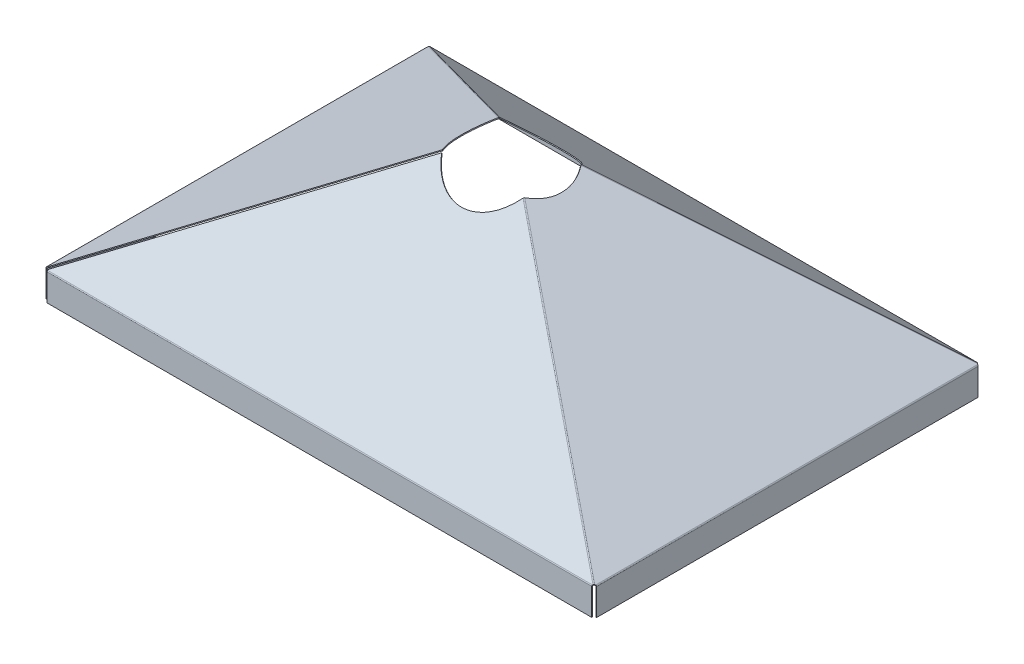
ISO-10303-21;
HEADER;
FILE_DESCRIPTION(('STEP AP214'),'2;1');
FILE_NAME('part.step','',(''),(''),'','','');
FILE_SCHEMA(('AUTOMOTIVE_DESIGN { 1 0 10303 214 1 1 1 1 }'));
ENDSEC;
DATA;
#1=APPLICATION_CONTEXT('core data for automotive mechanical design processes');
#2=APPLICATION_PROTOCOL_DEFINITION('international standard','automotive_design',2000,#1);
#3=PRODUCT_CONTEXT('',#1,'mechanical');
#4=PRODUCT('Part','Part','',(#3));
#5=PRODUCT_RELATED_PRODUCT_CATEGORY('part','',(#4));
#6=PRODUCT_DEFINITION_FORMATION('','',#4);
#7=PRODUCT_DEFINITION_CONTEXT('part definition',#1,'design');
#8=PRODUCT_DEFINITION('design','',#6,#7);
#9=PRODUCT_DEFINITION_SHAPE('','',#8);
#10=(LENGTH_UNIT() NAMED_UNIT(*) SI_UNIT(.MILLI.,.METRE.));
#11=(NAMED_UNIT(*) PLANE_ANGLE_UNIT() SI_UNIT($,.RADIAN.));
#12=(NAMED_UNIT(*) SI_UNIT($,.STERADIAN.) SOLID_ANGLE_UNIT());
#13=UNCERTAINTY_MEASURE_WITH_UNIT(LENGTH_MEASURE(1.E-05),#10,'distance_accuracy_value','');
#14=(GEOMETRIC_REPRESENTATION_CONTEXT(3) GLOBAL_UNCERTAINTY_ASSIGNED_CONTEXT((#13)) GLOBAL_UNIT_ASSIGNED_CONTEXT((#10,
#11,#12)) REPRESENTATION_CONTEXT('',''));
#15=CARTESIAN_POINT('',(0.,0.,0.));
#16=DIRECTION('',(0.,0.,1.));
#17=DIRECTION('',(1.,0.,0.));
#18=AXIS2_PLACEMENT_3D('',#15,#16,#17);
#19=CARTESIAN_POINT('',(-500.,0.,-1627.64964514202));
#20=DIRECTION('',(0.,-1.,0.));
#21=DIRECTION('',(0.,0.,-1.));
#22=AXIS2_PLACEMENT_3D('',#19,#20,#21);
#23=PLANE('',#22);
#24=DIRECTION('',(1.,0.,0.));
#25=VECTOR('',#24,1.);
#26=CARTESIAN_POINT('',(-500.,0.,350.));
#27=LINE('',#26,#25);
#28=CARTESIAN_POINT('',(-492.288586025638,0.,350.));
#29=VERTEX_POINT('',#28);
#30=CARTESIAN_POINT('',(495.329689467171,-2.77555756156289E-13,350.));
#31=VERTEX_POINT('',#30);
#32=EDGE_CURVE('E1244',#29,#31,#27,.T.);
#33=ORIENTED_EDGE('',*,*,#32,.F.);
#34=DIRECTION('',(0.,0.,1.));
#35=VECTOR('',#34,1.);
#36=CARTESIAN_POINT('',(-492.288586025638,0.,-1627.64964514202));
#37=LINE('',#36,#35);
#38=CARTESIAN_POINT('',(-492.288586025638,0.,348.5));
#39=VERTEX_POINT('',#38);
#40=EDGE_CURVE('E11',#39,#29,#37,.T.);
#41=ORIENTED_EDGE('',*,*,#40,.F.);
#42=DIRECTION('',(1.,0.,0.));
#43=VECTOR('',#42,1.);
#44=CARTESIAN_POINT('',(-500.,1.11022302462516E-13,348.5));
#45=LINE('',#44,#43);
#46=CARTESIAN_POINT('',(495.329689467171,0.,348.5));
#47=VERTEX_POINT('',#46);
#48=EDGE_CURVE('E52',#39,#47,#45,.T.);
#49=ORIENTED_EDGE('',*,*,#48,.T.);
#50=DIRECTION('',(0.,0.,1.));
#51=VECTOR('',#50,1.);
#52=CARTESIAN_POINT('',(495.329689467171,0.,-1627.64964514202));
#53=LINE('',#52,#51);
#54=EDGE_CURVE('E1257',#47,#31,#53,.T.);
#55=ORIENTED_EDGE('',*,*,#54,.T.);
#56=EDGE_LOOP('',(#33,#41,#49,#55));
#57=FACE_BOUND('',#56,.T.);
#58=ADVANCED_FACE('F33',(#57),#23,.T.);
#59=CARTESIAN_POINT('',(495.329689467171,300.,-1627.64964514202));
#60=DIRECTION('',(1.,0.,0.));
#61=DIRECTION('',(0.,0.766521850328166,-0.642218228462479));
#62=AXIS2_PLACEMENT_3D('',#59,#60,#61);
#63=PLANE('',#62);
#64=DIRECTION('',(0.,1.,0.));
#65=VECTOR('',#64,1.);
#66=CARTESIAN_POINT('',(495.329689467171,300.,350.));
#67=LINE('',#66,#65);
#68=CARTESIAN_POINT('',(495.329689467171,48.8330998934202,350.));
#69=VERTEX_POINT('',#68);
#70=EDGE_CURVE('E66',#31,#69,#67,.T.);
#71=ORIENTED_EDGE('',*,*,#70,.F.);
#72=ORIENTED_EDGE('',*,*,#54,.F.);
#73=DIRECTION('',(0.,1.,0.));
#74=VECTOR('',#73,1.);
#75=CARTESIAN_POINT('',(495.329689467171,300.,348.5));
#76=LINE('',#75,#74);
#77=CARTESIAN_POINT('',(495.329689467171,48.8330998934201,348.5));
#78=VERTEX_POINT('',#77);
#79=EDGE_CURVE('E1254',#47,#78,#76,.T.);
#80=ORIENTED_EDGE('',*,*,#79,.T.);
#81=DIRECTION('',(0.,0.,1.));
#82=VECTOR('',#81,1.);
#83=CARTESIAN_POINT('',(495.329689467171,48.8330998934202,-1627.64964514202));
#84=LINE('',#83,#82);
#85=EDGE_CURVE('E1252',#78,#69,#84,.T.);
#86=ORIENTED_EDGE('',*,*,#85,.T.);
#87=EDGE_LOOP('',(#71,#72,#80,#86));
#88=FACE_BOUND('',#87,.T.);
#89=ADVANCED_FACE('F1681',(#88),#63,.T.);
#90=CARTESIAN_POINT('',(-500.,300.,350.));
#91=DIRECTION('',(0.,0.,-1.));
#92=DIRECTION('',(-1.,0.,0.));
#93=AXIS2_PLACEMENT_3D('',#90,#91,#92);
#94=PLANE('',#93);
#95=ORIENTED_EDGE('',*,*,#70,.T.);
#96=DIRECTION('',(-1.,0.,0.));
#97=VECTOR('',#96,1.);
#98=CARTESIAN_POINT('',(495.329689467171,48.8330998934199,350.));
#99=LINE('',#98,#97);
#100=CARTESIAN_POINT('',(-492.288586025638,48.8330998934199,350.));
#101=VERTEX_POINT('',#100);
#102=EDGE_CURVE('E441',#69,#101,#99,.T.);
#103=ORIENTED_EDGE('',*,*,#102,.T.);
#104=DIRECTION('',(0.,-1.,0.));
#105=VECTOR('',#104,1.);
#106=CARTESIAN_POINT('',(-492.288586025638,300.,350.));
#107=LINE('',#106,#105);
#108=EDGE_CURVE('E1247',#101,#29,#107,.T.);
#109=ORIENTED_EDGE('',*,*,#108,.T.);
#110=ORIENTED_EDGE('',*,*,#32,.T.);
#111=EDGE_LOOP('',(#95,#103,#109,#110));
#112=FACE_BOUND('',#111,.T.);
#113=ADVANCED_FACE('F1687',(#112),#94,.F.);
#114=CARTESIAN_POINT('',(-492.288586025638,300.,-1627.64964514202));
#115=DIRECTION('',(-1.,0.,0.));
#116=DIRECTION('',(0.,-0.766521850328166,0.642218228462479));
#117=AXIS2_PLACEMENT_3D('',#114,#115,#116);
#118=PLANE('',#117);
#119=ORIENTED_EDGE('',*,*,#108,.F.);
#120=DIRECTION('',(0.,0.,1.));
#121=VECTOR('',#120,1.);
#122=CARTESIAN_POINT('',(-492.288586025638,48.8330998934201,-1627.64964514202));
#123=LINE('',#122,#121);
#124=CARTESIAN_POINT('',(-492.288586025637,48.83309989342,348.5));
#125=VERTEX_POINT('',#124);
#126=EDGE_CURVE('E1259',#125,#101,#123,.T.);
#127=ORIENTED_EDGE('',*,*,#126,.F.);
#128=DIRECTION('',(0.,-1.,0.));
#129=VECTOR('',#128,1.);
#130=CARTESIAN_POINT('',(-492.288586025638,300.,348.5));
#131=LINE('',#130,#129);
#132=EDGE_CURVE('E43',#125,#39,#131,.T.);
#133=ORIENTED_EDGE('',*,*,#132,.T.);
#134=ORIENTED_EDGE('',*,*,#40,.T.);
#135=EDGE_LOOP('',(#119,#127,#133,#134));
#136=FACE_BOUND('',#135,.T.);
#137=ADVANCED_FACE('F1693',(#136),#118,.T.);
#138=CARTESIAN_POINT('',(-500.,300.,348.5));
#139=DIRECTION('',(0.,0.,-1.));
#140=DIRECTION('',(-1.,0.,0.));
#141=AXIS2_PLACEMENT_3D('',#138,#139,#140);
#142=PLANE('',#141);
#143=DIRECTION('',(-1.,0.,0.));
#144=VECTOR('',#143,1.);
#145=CARTESIAN_POINT('',(495.329689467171,48.83309989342,348.5));
#146=LINE('',#145,#144);
#147=EDGE_CURVE('E37',#78,#125,#146,.T.);
#148=ORIENTED_EDGE('',*,*,#147,.F.);
#149=ORIENTED_EDGE('',*,*,#79,.F.);
#150=ORIENTED_EDGE('',*,*,#48,.F.);
#151=ORIENTED_EDGE('',*,*,#132,.F.);
#152=EDGE_LOOP('',(#148,#149,#150,#151));
#153=FACE_BOUND('',#152,.T.);
#154=ADVANCED_FACE('F35',(#153),#142,.T.);
#155=CARTESIAN_POINT('',(-923.246193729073,0.,-350.));
#156=DIRECTION('',(0.,-1.,0.));
#157=DIRECTION('',(-0.634843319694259,0.,-0.772640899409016));
#158=AXIS2_PLACEMENT_3D('',#155,#156,#157);
#159=PLANE('',#158);
#160=DIRECTION('',(0.,0.,-1.));
#161=VECTOR('',#160,1.);
#162=CARTESIAN_POINT('',(500.,-2.77555756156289E-13,-350.));
#163=LINE('',#162,#161);
#164=CARTESIAN_POINT('',(500.,-1.66533453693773E-13,345.788634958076));
#165=VERTEX_POINT('',#164);
#166=CARTESIAN_POINT('',(500.,-4.9960036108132E-13,-345.788634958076));
#167=VERTEX_POINT('',#166);
#168=EDGE_CURVE('E1273',#165,#167,#163,.T.);
#169=ORIENTED_EDGE('',*,*,#168,.F.);
#170=DIRECTION('',(1.,0.,0.));
#171=VECTOR('',#170,1.);
#172=CARTESIAN_POINT('',(-923.246193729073,2.22044604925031E-13,345.788634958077));
#173=LINE('',#172,#171);
#174=CARTESIAN_POINT('',(498.5,-2.77555756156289E-13,345.788634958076));
#175=VERTEX_POINT('',#174);
#176=EDGE_CURVE('E1264',#175,#165,#173,.T.);
#177=ORIENTED_EDGE('',*,*,#176,.F.);
#178=DIRECTION('',(0.,0.,-1.));
#179=VECTOR('',#178,1.);
#180=CARTESIAN_POINT('',(498.5,-3.33066907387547E-13,-350.));
#181=LINE('',#180,#179);
#182=CARTESIAN_POINT('',(498.5,-2.77555756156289E-13,-345.788634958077));
#183=VERTEX_POINT('',#182);
#184=EDGE_CURVE('E83',#175,#183,#181,.T.);
#185=ORIENTED_EDGE('',*,*,#184,.T.);
#186=DIRECTION('',(1.,0.,0.));
#187=VECTOR('',#186,1.);
#188=CARTESIAN_POINT('',(-923.246193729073,0.,-345.788634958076));
#189=LINE('',#188,#187);
#190=EDGE_CURVE('E1295',#183,#167,#189,.T.);
#191=ORIENTED_EDGE('',*,*,#190,.T.);
#192=EDGE_LOOP('',(#169,#177,#185,#191));
#193=FACE_BOUND('',#192,.T.);
#194=ADVANCED_FACE('F1700',(#193),#159,.T.);
#195=CARTESIAN_POINT('',(-923.246193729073,300.,-345.788634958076));
#196=DIRECTION('',(0.,0.,-1.));
#197=DIRECTION('',(1.,0.,0.));
#198=AXIS2_PLACEMENT_3D('',#195,#196,#197);
#199=PLANE('',#198);
#200=DIRECTION('',(0.,1.,0.));
#201=VECTOR('',#200,1.);
#202=CARTESIAN_POINT('',(500.,300.,-345.788634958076));
#203=LINE('',#202,#201);
#204=CARTESIAN_POINT('',(500.,48.5679739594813,-345.788634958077));
#205=VERTEX_POINT('',#204);
#206=EDGE_CURVE('E98',#167,#205,#203,.T.);
#207=ORIENTED_EDGE('',*,*,#206,.F.);
#208=ORIENTED_EDGE('',*,*,#190,.F.);
#209=DIRECTION('',(0.,1.,0.));
#210=VECTOR('',#209,1.);
#211=CARTESIAN_POINT('',(498.5,300.,-345.788634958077));
#212=LINE('',#211,#210);
#213=CARTESIAN_POINT('',(498.5,48.5679739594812,-345.788634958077));
#214=VERTEX_POINT('',#213);
#215=EDGE_CURVE('E1292',#183,#214,#212,.T.);
#216=ORIENTED_EDGE('',*,*,#215,.T.);
#217=DIRECTION('',(1.,0.,0.));
#218=VECTOR('',#217,1.);
#219=CARTESIAN_POINT('',(-923.246193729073,48.5679739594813,-345.788634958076));
#220=LINE('',#219,#218);
#221=EDGE_CURVE('E1290',#214,#205,#220,.T.);
#222=ORIENTED_EDGE('',*,*,#221,.T.);
#223=EDGE_LOOP('',(#207,#208,#216,#222));
#224=FACE_BOUND('',#223,.T.);
#225=ADVANCED_FACE('F2218',(#224),#199,.T.);
#226=CARTESIAN_POINT('',(500.,300.,-350.));
#227=DIRECTION('',(-1.,0.,0.));
#228=DIRECTION('',(0.,0.,1.));
#229=AXIS2_PLACEMENT_3D('',#226,#227,#228);
#230=PLANE('',#229);
#231=ORIENTED_EDGE('',*,*,#206,.T.);
#232=DIRECTION('',(0.,0.,1.));
#233=VECTOR('',#232,1.);
#234=CARTESIAN_POINT('',(500.,48.567973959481,-345.788634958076));
#235=LINE('',#234,#233);
#236=CARTESIAN_POINT('',(500.,48.5679739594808,345.788634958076));
#237=VERTEX_POINT('',#236);
#238=EDGE_CURVE('E1286',#205,#237,#235,.T.);
#239=ORIENTED_EDGE('',*,*,#238,.T.);
#240=DIRECTION('',(0.,-1.,0.));
#241=VECTOR('',#240,1.);
#242=CARTESIAN_POINT('',(500.,300.,345.788634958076));
#243=LINE('',#242,#241);
#244=EDGE_CURVE('E1283',#237,#165,#243,.T.);
#245=ORIENTED_EDGE('',*,*,#244,.T.);
#246=ORIENTED_EDGE('',*,*,#168,.T.);
#247=EDGE_LOOP('',(#231,#239,#245,#246));
#248=FACE_BOUND('',#247,.T.);
#249=ADVANCED_FACE('F2210',(#248),#230,.F.);
#250=CARTESIAN_POINT('',(-923.246193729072,300.,345.788634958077));
#251=DIRECTION('',(0.,0.,1.));
#252=DIRECTION('',(-1.,0.,0.));
#253=AXIS2_PLACEMENT_3D('',#250,#251,#252);
#254=PLANE('',#253);
#255=ORIENTED_EDGE('',*,*,#244,.F.);
#256=DIRECTION('',(1.,0.,0.));
#257=VECTOR('',#256,1.);
#258=CARTESIAN_POINT('',(-923.246193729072,48.5679739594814,345.788634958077));
#259=LINE('',#258,#257);
#260=CARTESIAN_POINT('',(498.5,48.5679739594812,345.788634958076));
#261=VERTEX_POINT('',#260);
#262=EDGE_CURVE('E1298',#261,#237,#259,.T.);
#263=ORIENTED_EDGE('',*,*,#262,.F.);
#264=DIRECTION('',(0.,-1.,0.));
#265=VECTOR('',#264,1.);
#266=CARTESIAN_POINT('',(498.5,300.,345.788634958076));
#267=LINE('',#266,#265);
#268=EDGE_CURVE('E1267',#261,#175,#267,.T.);
#269=ORIENTED_EDGE('',*,*,#268,.T.);
#270=ORIENTED_EDGE('',*,*,#176,.T.);
#271=EDGE_LOOP('',(#255,#263,#269,#270));
#272=FACE_BOUND('',#271,.T.);
#273=ADVANCED_FACE('F1677',(#272),#254,.T.);
#274=CARTESIAN_POINT('',(498.5,300.,-350.));
#275=DIRECTION('',(-1.,0.,0.));
#276=DIRECTION('',(0.,0.,1.));
#277=AXIS2_PLACEMENT_3D('',#274,#275,#276);
#278=PLANE('',#277);
#279=ORIENTED_EDGE('',*,*,#215,.F.);
#280=ORIENTED_EDGE('',*,*,#184,.F.);
#281=ORIENTED_EDGE('',*,*,#268,.F.);
#282=DIRECTION('',(0.,0.,1.));
#283=VECTOR('',#282,1.);
#284=CARTESIAN_POINT('',(498.5,48.5679739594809,-345.788634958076));
#285=LINE('',#284,#283);
#286=EDGE_CURVE('E1300',#214,#261,#285,.T.);
#287=ORIENTED_EDGE('',*,*,#286,.F.);
#288=EDGE_LOOP('',(#279,#280,#281,#287));
#289=FACE_BOUND('',#288,.T.);
#290=ADVANCED_FACE('F1670',(#289),#278,.T.);
#291=CARTESIAN_POINT('',(-499.999999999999,1.11022302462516E-13,1701.67490359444));
#292=DIRECTION('',(0.,-1.,0.));
#293=DIRECTION('',(0.,0.,-1.));
#294=AXIS2_PLACEMENT_3D('',#291,#292,#293);
#295=PLANE('',#294);
#296=DIRECTION('',(-1.,0.,0.));
#297=VECTOR('',#296,1.);
#298=CARTESIAN_POINT('',(-500.,3.88578058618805E-13,-350.));
#299=LINE('',#298,#297);
#300=CARTESIAN_POINT('',(495.32968946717,0.,-350.));
#301=VERTEX_POINT('',#300);
#302=CARTESIAN_POINT('',(-495.329689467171,2.22044604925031E-13,-349.999999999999));
#303=VERTEX_POINT('',#302);
#304=EDGE_CURVE('E1609',#301,#303,#299,.T.);
#305=ORIENTED_EDGE('',*,*,#304,.F.);
#306=DIRECTION('',(0.,0.,-1.));
#307=VECTOR('',#306,1.);
#308=CARTESIAN_POINT('',(495.329689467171,0.,1701.67490359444));
#309=LINE('',#308,#307);
#310=CARTESIAN_POINT('',(495.32968946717,-2.77555756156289E-13,-348.5));
#311=VERTEX_POINT('',#310);
#312=EDGE_CURVE('E1302',#311,#301,#309,.T.);
#313=ORIENTED_EDGE('',*,*,#312,.F.);
#314=DIRECTION('',(-1.,0.,0.));
#315=VECTOR('',#314,1.);
#316=CARTESIAN_POINT('',(-500.,2.22044604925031E-13,-348.5));
#317=LINE('',#316,#315);
#318=CARTESIAN_POINT('',(-495.329689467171,1.11022302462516E-13,-348.5));
#319=VERTEX_POINT('',#318);
#320=EDGE_CURVE('E115',#311,#319,#317,.T.);
#321=ORIENTED_EDGE('',*,*,#320,.T.);
#322=DIRECTION('',(0.,0.,-1.));
#323=VECTOR('',#322,1.);
#324=CARTESIAN_POINT('',(-495.329689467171,-1.11022302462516E-13,1701.67490359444));
#325=LINE('',#324,#323);
#326=EDGE_CURVE('E1595',#319,#303,#325,.T.);
#327=ORIENTED_EDGE('',*,*,#326,.T.);
#328=EDGE_LOOP('',(#305,#313,#321,#327));
#329=FACE_BOUND('',#328,.T.);
#330=ADVANCED_FACE('F1668',(#329),#295,.T.);
#331=CARTESIAN_POINT('',(-495.32968946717,300.,1701.67490359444));
#332=DIRECTION('',(-1.,0.,0.));
#333=DIRECTION('',(0.,0.790898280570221,-0.611947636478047));
#334=AXIS2_PLACEMENT_3D('',#331,#332,#333);
#335=PLANE('',#334);
#336=DIRECTION('',(0.,1.,0.));
#337=VECTOR('',#336,1.);
#338=CARTESIAN_POINT('',(-495.329689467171,300.,-350.));
#339=LINE('',#338,#337);
#340=CARTESIAN_POINT('',(-495.329689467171,48.8330998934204,-350.));
#341=VERTEX_POINT('',#340);
#342=EDGE_CURVE('E130',#303,#341,#339,.T.);
#343=ORIENTED_EDGE('',*,*,#342,.F.);
#344=ORIENTED_EDGE('',*,*,#326,.F.);
#345=DIRECTION('',(0.,1.,0.));
#346=VECTOR('',#345,1.);
#347=CARTESIAN_POINT('',(-495.329689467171,300.,-348.5));
#348=LINE('',#347,#346);
#349=CARTESIAN_POINT('',(-495.329689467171,48.8330998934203,-348.5));
#350=VERTEX_POINT('',#349);
#351=EDGE_CURVE('E1597',#319,#350,#348,.T.);
#352=ORIENTED_EDGE('',*,*,#351,.T.);
#353=DIRECTION('',(0.,0.,-1.));
#354=VECTOR('',#353,1.);
#355=CARTESIAN_POINT('',(-495.32968946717,48.8330998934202,1701.67490359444));
#356=LINE('',#355,#354);
#357=EDGE_CURVE('E1600',#350,#341,#356,.T.);
#358=ORIENTED_EDGE('',*,*,#357,.T.);
#359=EDGE_LOOP('',(#343,#344,#352,#358));
#360=FACE_BOUND('',#359,.T.);
#361=ADVANCED_FACE('F1664',(#360),#335,.T.);
#362=CARTESIAN_POINT('',(-500.,300.,-350.));
#363=DIRECTION('',(0.,0.,1.));
#364=DIRECTION('',(1.,0.,0.));
#365=AXIS2_PLACEMENT_3D('',#362,#363,#364);
#366=PLANE('',#365);
#367=ORIENTED_EDGE('',*,*,#342,.T.);
#368=DIRECTION('',(1.,0.,0.));
#369=VECTOR('',#368,1.);
#370=CARTESIAN_POINT('',(-495.329689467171,48.8330998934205,-349.999999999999));
#371=LINE('',#370,#369);
#372=CARTESIAN_POINT('',(495.32968946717,48.83309989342,-350.));
#373=VERTEX_POINT('',#372);
#374=EDGE_CURVE('E1603',#341,#373,#371,.T.);
#375=ORIENTED_EDGE('',*,*,#374,.T.);
#376=DIRECTION('',(0.,-1.,0.));
#377=VECTOR('',#376,1.);
#378=CARTESIAN_POINT('',(495.32968946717,300.,-350.));
#379=LINE('',#378,#377);
#380=EDGE_CURVE('E1606',#373,#301,#379,.T.);
#381=ORIENTED_EDGE('',*,*,#380,.T.);
#382=ORIENTED_EDGE('',*,*,#304,.T.);
#383=EDGE_LOOP('',(#367,#375,#381,#382));
#384=FACE_BOUND('',#383,.T.);
#385=ADVANCED_FACE('F1659',(#384),#366,.F.);
#386=CARTESIAN_POINT('',(495.329689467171,300.,1701.67490359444));
#387=DIRECTION('',(1.,0.,0.));
#388=DIRECTION('',(0.,-0.790898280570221,0.611947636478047));
#389=AXIS2_PLACEMENT_3D('',#386,#387,#388);
#390=PLANE('',#389);
#391=ORIENTED_EDGE('',*,*,#380,.F.);
#392=DIRECTION('',(0.,0.,-1.));
#393=VECTOR('',#392,1.);
#394=CARTESIAN_POINT('',(495.329689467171,48.8330998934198,1701.67490359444));
#395=LINE('',#394,#393);
#396=CARTESIAN_POINT('',(495.329689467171,48.8330998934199,-348.5));
#397=VERTEX_POINT('',#396);
#398=EDGE_CURVE('E1591',#397,#373,#395,.T.);
#399=ORIENTED_EDGE('',*,*,#398,.F.);
#400=DIRECTION('',(0.,-1.,0.));
#401=VECTOR('',#400,1.);
#402=CARTESIAN_POINT('',(495.32968946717,300.,-348.5));
#403=LINE('',#402,#401);
#404=EDGE_CURVE('E1612',#397,#311,#403,.T.);
#405=ORIENTED_EDGE('',*,*,#404,.T.);
#406=ORIENTED_EDGE('',*,*,#312,.T.);
#407=EDGE_LOOP('',(#391,#399,#405,#406));
#408=FACE_BOUND('',#407,.T.);
#409=ADVANCED_FACE('F1655',(#408),#390,.T.);
#410=CARTESIAN_POINT('',(-500.,300.,-348.5));
#411=DIRECTION('',(0.,0.,1.));
#412=DIRECTION('',(1.,0.,0.));
#413=AXIS2_PLACEMENT_3D('',#410,#411,#412);
#414=PLANE('',#413);
#415=ORIENTED_EDGE('',*,*,#351,.F.);
#416=ORIENTED_EDGE('',*,*,#320,.F.);
#417=ORIENTED_EDGE('',*,*,#404,.F.);
#418=DIRECTION('',(1.,0.,0.));
#419=VECTOR('',#418,1.);
#420=CARTESIAN_POINT('',(-495.329689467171,48.8330998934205,-348.5));
#421=LINE('',#420,#419);
#422=EDGE_CURVE('E1588',#350,#397,#421,.T.);
#423=ORIENTED_EDGE('',*,*,#422,.F.);
#424=EDGE_LOOP('',(#415,#416,#417,#423));
#425=FACE_BOUND('',#424,.T.);
#426=ADVANCED_FACE('F1666',(#425),#414,.T.);
#427=CARTESIAN_POINT('',(970.469632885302,0.,-350.));
#428=DIRECTION('',(0.,-1.,0.));
#429=DIRECTION('',(-0.571221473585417,0.,0.820795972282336));
#430=AXIS2_PLACEMENT_3D('',#427,#428,#429);
#431=PLANE('',#430);
#432=DIRECTION('',(0.,0.,1.));
#433=VECTOR('',#432,1.);
#434=CARTESIAN_POINT('',(-500.,-2.22044604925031E-13,-349.999999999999));
#435=LINE('',#434,#433);
#436=CARTESIAN_POINT('',(-500.,-1.66533453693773E-13,-345.788634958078));
#437=VERTEX_POINT('',#436);
#438=CARTESIAN_POINT('',(-500.,-2.77555756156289E-13,344.288200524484));
#439=VERTEX_POINT('',#438);
#440=EDGE_CURVE('E2379',#437,#439,#435,.T.);
#441=ORIENTED_EDGE('',*,*,#440,.F.);
#442=DIRECTION('',(-1.,0.,0.));
#443=VECTOR('',#442,1.);
#444=CARTESIAN_POINT('',(970.469632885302,-1.11022302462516E-13,-345.788634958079));
#445=LINE('',#444,#443);
#446=CARTESIAN_POINT('',(-498.5,-2.22044604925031E-13,-345.788634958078));
#447=VERTEX_POINT('',#446);
#448=EDGE_CURVE('E1592',#447,#437,#445,.T.);
#449=ORIENTED_EDGE('',*,*,#448,.F.);
#450=DIRECTION('',(0.,0.,1.));
#451=VECTOR('',#450,1.);
#452=CARTESIAN_POINT('',(-498.5,-2.22044604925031E-13,-349.999999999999));
#453=LINE('',#452,#451);
#454=CARTESIAN_POINT('',(-498.5,-5.55111512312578E-13,344.288200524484));
#455=VERTEX_POINT('',#454);
#456=EDGE_CURVE('E147',#447,#455,#453,.T.);
#457=ORIENTED_EDGE('',*,*,#456,.T.);
#458=DIRECTION('',(-1.,0.,0.));
#459=VECTOR('',#458,1.);
#460=CARTESIAN_POINT('',(970.469632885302,-1.11022302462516E-13,344.288200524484));
#461=LINE('',#460,#459);
#462=EDGE_CURVE('E2393',#455,#439,#461,.T.);
#463=ORIENTED_EDGE('',*,*,#462,.T.);
#464=EDGE_LOOP('',(#441,#449,#457,#463));
#465=FACE_BOUND('',#464,.T.);
#466=ADVANCED_FACE('F2152',(#465),#431,.T.);
#467=CARTESIAN_POINT('',(970.469632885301,300.,344.288200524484));
#468=DIRECTION('',(0.,0.,1.));
#469=DIRECTION('',(-0.422774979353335,0.906234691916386,0.));
#470=AXIS2_PLACEMENT_3D('',#467,#468,#469);
#471=PLANE('',#470);
#472=DIRECTION('',(0.,1.,0.));
#473=VECTOR('',#472,1.);
#474=CARTESIAN_POINT('',(-500.,300.,344.288200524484));
#475=LINE('',#474,#473);
#476=CARTESIAN_POINT('',(-500.,48.5679739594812,344.288200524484));
#477=VERTEX_POINT('',#476);
#478=EDGE_CURVE('E162',#439,#477,#475,.T.);
#479=ORIENTED_EDGE('',*,*,#478,.F.);
#480=ORIENTED_EDGE('',*,*,#462,.F.);
#481=DIRECTION('',(0.,1.,0.));
#482=VECTOR('',#481,1.);
#483=CARTESIAN_POINT('',(-498.5,300.,344.288200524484));
#484=LINE('',#483,#482);
#485=CARTESIAN_POINT('',(-498.5,48.5679739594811,344.288200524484));
#486=VERTEX_POINT('',#485);
#487=EDGE_CURVE('E2391',#455,#486,#484,.T.);
#488=ORIENTED_EDGE('',*,*,#487,.T.);
#489=DIRECTION('',(-1.,0.,0.));
#490=VECTOR('',#489,1.);
#491=CARTESIAN_POINT('',(970.469632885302,48.5679739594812,344.288200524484));
#492=LINE('',#491,#490);
#493=EDGE_CURVE('E2389',#486,#477,#492,.T.);
#494=ORIENTED_EDGE('',*,*,#493,.T.);
#495=EDGE_LOOP('',(#479,#480,#488,#494));
#496=FACE_BOUND('',#495,.T.);
#497=ADVANCED_FACE('F2142',(#496),#471,.T.);
#498=CARTESIAN_POINT('',(-500.,300.,-349.999999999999));
#499=DIRECTION('',(1.,0.,0.));
#500=DIRECTION('',(0.,0.,-1.));
#501=AXIS2_PLACEMENT_3D('',#498,#499,#500);
#502=PLANE('',#501);
#503=ORIENTED_EDGE('',*,*,#478,.T.);
#504=DIRECTION('',(0.,0.,-1.));
#505=VECTOR('',#504,1.);
#506=CARTESIAN_POINT('',(-500.,48.5679739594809,344.288200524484));
#507=LINE('',#506,#505);
#508=CARTESIAN_POINT('',(-500.,48.5679739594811,-345.788634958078));
#509=VERTEX_POINT('',#508);
#510=EDGE_CURVE('E2385',#477,#509,#507,.T.);
#511=ORIENTED_EDGE('',*,*,#510,.T.);
#512=DIRECTION('',(0.,-1.,0.));
#513=VECTOR('',#512,1.);
#514=CARTESIAN_POINT('',(-500.,300.,-345.788634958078));
#515=LINE('',#514,#513);
#516=EDGE_CURVE('E2382',#509,#437,#515,.T.);
#517=ORIENTED_EDGE('',*,*,#516,.T.);
#518=ORIENTED_EDGE('',*,*,#440,.T.);
#519=EDGE_LOOP('',(#503,#511,#517,#518));
#520=FACE_BOUND('',#519,.T.);
#521=ADVANCED_FACE('F2132',(#520),#502,.F.);
#522=CARTESIAN_POINT('',(970.469632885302,300.,-345.788634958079));
#523=DIRECTION('',(0.,0.,-1.));
#524=DIRECTION('',(0.422774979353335,-0.906234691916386,0.));
#525=AXIS2_PLACEMENT_3D('',#522,#523,#524);
#526=PLANE('',#525);
#527=ORIENTED_EDGE('',*,*,#516,.F.);
#528=DIRECTION('',(-1.,0.,0.));
#529=VECTOR('',#528,1.);
#530=CARTESIAN_POINT('',(970.469632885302,48.567973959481,-345.788634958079));
#531=LINE('',#530,#529);
#532=CARTESIAN_POINT('',(-498.5,48.5679739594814,-345.788634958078));
#533=VERTEX_POINT('',#532);
#534=EDGE_CURVE('E1385',#533,#509,#531,.T.);
#535=ORIENTED_EDGE('',*,*,#534,.F.);
#536=DIRECTION('',(0.,-1.,0.));
#537=VECTOR('',#536,1.);
#538=CARTESIAN_POINT('',(-498.5,300.,-345.788634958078));
#539=LINE('',#538,#537);
#540=EDGE_CURVE('E2377',#533,#447,#539,.T.);
#541=ORIENTED_EDGE('',*,*,#540,.T.);
#542=ORIENTED_EDGE('',*,*,#448,.T.);
#543=EDGE_LOOP('',(#527,#535,#541,#542));
#544=FACE_BOUND('',#543,.T.);
#545=ADVANCED_FACE('F2124',(#544),#526,.T.);
#546=CARTESIAN_POINT('',(-498.5,300.,-349.999999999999));
#547=DIRECTION('',(1.,0.,0.));
#548=DIRECTION('',(0.,0.,-1.));
#549=AXIS2_PLACEMENT_3D('',#546,#547,#548);
#550=PLANE('',#549);
#551=DIRECTION('',(0.,0.,-1.));
#552=VECTOR('',#551,1.);
#553=CARTESIAN_POINT('',(-498.5,48.567973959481,344.288200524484));
#554=LINE('',#553,#552);
#555=EDGE_CURVE('E1383',#486,#533,#554,.T.);
#556=ORIENTED_EDGE('',*,*,#555,.F.);
#557=ORIENTED_EDGE('',*,*,#487,.F.);
#558=ORIENTED_EDGE('',*,*,#456,.F.);
#559=ORIENTED_EDGE('',*,*,#540,.F.);
#560=EDGE_LOOP('',(#556,#557,#558,#559));
#561=FACE_BOUND('',#560,.T.);
#562=ADVANCED_FACE('F2115',(#561),#550,.T.);
#563=CARTESIAN_POINT('',(807.046988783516,-1201.79364117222,344.288200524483));
#564=DIRECTION('',(0.,0.,1.));
#565=DIRECTION('',(0.56783158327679,0.823144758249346,0.));
#566=AXIS2_PLACEMENT_3D('',#563,#564,#565);
#567=PLANE('',#566);
#568=DIRECTION('',(0.862593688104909,0.505897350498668,0.));
#569=VECTOR('',#568,1.);
#570=CARTESIAN_POINT('',(-73.7308728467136,300.,344.288200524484));
#571=LINE('',#570,#569);
#572=CARTESIAN_POINT('',(-498.764743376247,50.7244581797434,344.288200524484));
#573=VERTEX_POINT('',#572);
#574=CARTESIAN_POINT('',(-496.086719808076,52.2950760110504,344.288200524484));
#575=VERTEX_POINT('',#574);
#576=EDGE_CURVE('E2447',#573,#575,#571,.T.);
#577=ORIENTED_EDGE('',*,*,#576,.F.);
#578=DIRECTION('',(-0.505897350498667,0.862593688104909,0.));
#579=VECTOR('',#578,1.);
#580=CARTESIAN_POINT('',(382.013118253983,-1451.06918299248,344.288200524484));
#581=LINE('',#580,#579);
#582=CARTESIAN_POINT('',(-498.005897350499,49.430567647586,344.288200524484));
#583=VERTEX_POINT('',#582);
#584=EDGE_CURVE('E2400',#583,#573,#581,.T.);
#585=ORIENTED_EDGE('',*,*,#584,.F.);
#586=DIRECTION('',(0.862593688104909,0.505897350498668,0.));
#587=VECTOR('',#586,1.);
#588=CARTESIAN_POINT('',(-72.9720268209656,298.706109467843,344.288200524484));
#589=LINE('',#588,#587);
#590=CARTESIAN_POINT('',(-495.327873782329,51.0011854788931,344.288200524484));
#591=VERTEX_POINT('',#590);
#592=EDGE_CURVE('E2401',#583,#591,#589,.T.);
#593=ORIENTED_EDGE('',*,*,#592,.T.);
#594=DIRECTION('',(-0.505897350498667,0.862593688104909,0.));
#595=VECTOR('',#594,1.);
#596=CARTESIAN_POINT('',(384.691141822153,-1449.49856516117,344.288200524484));
#597=LINE('',#596,#595);
#598=EDGE_CURVE('E2404',#591,#575,#597,.T.);
#599=ORIENTED_EDGE('',*,*,#598,.T.);
#600=EDGE_LOOP('',(#577,#585,#593,#599));
#601=FACE_BOUND('',#600,.T.);
#602=ADVANCED_FACE('F2106',(#601),#567,.T.);
#603=CARTESIAN_POINT('',(92.3050500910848,-1620.97831416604,548.958464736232));
#604=DIRECTION('',(0.445870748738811,0.261496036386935,0.856048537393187));
#605=DIRECTION('',(0.505897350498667,-0.862593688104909,0.));
#606=AXIS2_PLACEMENT_3D('',#603,#604,#605);
#607=PLANE('',#606);
#608=DIRECTION('',(0.738422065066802,0.433072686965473,-0.516895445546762));
#609=VECTOR('',#608,1.);
#610=CARTESIAN_POINT('',(-788.472811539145,-119.184672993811,548.958464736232));
#611=LINE('',#610,#609);
#612=CARTESIAN_POINT('',(-75.6184361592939,298.89297441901,49.9604019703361));
#613=VERTEX_POINT('',#612);
#614=EDGE_CURVE('E196',#575,#613,#611,.T.);
#615=ORIENTED_EDGE('',*,*,#614,.F.);
#616=ORIENTED_EDGE('',*,*,#598,.F.);
#617=DIRECTION('',(0.738422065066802,0.433072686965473,-0.516895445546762));
#618=VECTOR('',#617,1.);
#619=CARTESIAN_POINT('',(-787.713965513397,-120.478563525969,548.958464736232));
#620=LINE('',#619,#618);
#621=CARTESIAN_POINT('',(-74.8595901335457,297.599083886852,49.9604019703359));
#622=VERTEX_POINT('',#621);
#623=EDGE_CURVE('E179',#591,#622,#620,.T.);
#624=ORIENTED_EDGE('',*,*,#623,.T.);
#625=DIRECTION('',(-0.505897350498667,0.862593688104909,0.));
#626=VECTOR('',#625,1.);
#627=CARTESIAN_POINT('',(805.159425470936,-1202.90066675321,49.9604019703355));
#628=LINE('',#627,#626);
#629=EDGE_CURVE('E2450',#622,#613,#628,.T.);
#630=ORIENTED_EDGE('',*,*,#629,.T.);
#631=EDGE_LOOP('',(#615,#616,#624,#630));
#632=FACE_BOUND('',#631,.T.);
#633=ADVANCED_FACE('F2096',(#632),#607,.T.);
#634=CARTESIAN_POINT('',(880.019015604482,-1158.99671889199,0.));
#635=DIRECTION('',(0.505897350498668,-0.862593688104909,0.));
#636=DIRECTION('',(0.862593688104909,0.505897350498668,0.));
#637=AXIS2_PLACEMENT_3D('',#634,#635,#636);
#638=ELLIPSE('',#637,104.336492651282,90.);
#639=DIRECTION('',(-0.505897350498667,0.862593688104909,0.));
#640=VECTOR('',#639,1.);
#641=SURFACE_OF_LINEAR_EXTRUSION('',#638,#640);
#642=CARTESIAN_POINT('',(-0.758846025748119,342.796922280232,4.16333634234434E-13));
#643=DIRECTION('',(0.505897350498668,-0.862593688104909,0.));
#644=DIRECTION('',(0.862593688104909,0.505897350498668,0.));
#645=AXIS2_PLACEMENT_3D('',#642,#643,#644);
#646=ELLIPSE('',#645,104.336492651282,90.);
#647=CARTESIAN_POINT('',(-74.8578775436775,299.339029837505,-51.0816359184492));
#648=VERTEX_POINT('',#647);
#649=EDGE_CURVE('E2417',#613,#648,#646,.T.);
#650=ORIENTED_EDGE('',*,*,#649,.F.);
#651=ORIENTED_EDGE('',*,*,#629,.F.);
#652=CARTESIAN_POINT('',(0.,341.503031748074,3.05311331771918E-13));
#653=DIRECTION('',(0.505897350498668,-0.862593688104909,0.));
#654=DIRECTION('',(0.862593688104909,0.505897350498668,0.));
#655=AXIS2_PLACEMENT_3D('',#652,#653,#654);
#656=ELLIPSE('',#655,104.336492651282,90.);
#657=CARTESIAN_POINT('',(-74.0990315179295,298.045139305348,-51.0816359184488));
#658=VERTEX_POINT('',#657);
#659=EDGE_CURVE('E2452',#622,#658,#656,.T.);
#660=ORIENTED_EDGE('',*,*,#659,.T.);
#661=CARTESIAN_POINT('',(-74.0990315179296,298.045139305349,-51.0816359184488));
#662=DIRECTION('',(-0.505897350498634,0.862593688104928,0.));
#663=VECTOR('',#662,1.);
#664=LINE('',#661,#663);
#665=EDGE_CURVE('E2428',#658,#648,#664,.T.);
#666=ORIENTED_EDGE('',*,*,#665,.T.);
#667=EDGE_LOOP('',(#650,#651,#660,#666));
#668=FACE_BOUND('',#667,.T.);
#669=ADVANCED_FACE('F2086',(#668),#641,.T.);
#670=CARTESIAN_POINT('',(-73.7308728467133,300.,1921.22563624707));
#671=DIRECTION('',(0.505897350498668,-0.862593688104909,0.));
#672=DIRECTION('',(0.862593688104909,0.505897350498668,0.));
#673=AXIS2_PLACEMENT_3D('',#670,#671,#672);
#674=PLANE('',#673);
#675=DIRECTION('',(0.,0.,-1.));
#676=VECTOR('',#675,1.);
#677=CARTESIAN_POINT('',(-498.764743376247,50.7244581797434,344.288200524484));
#678=LINE('',#677,#676);
#679=CARTESIAN_POINT('',(-498.764743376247,50.7244581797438,-346.506078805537));
#680=VERTEX_POINT('',#679);
#681=EDGE_CURVE('E2453',#573,#680,#678,.T.);
#682=ORIENTED_EDGE('',*,*,#681,.F.);
#683=ORIENTED_EDGE('',*,*,#576,.T.);
#684=ORIENTED_EDGE('',*,*,#614,.T.);
#685=ORIENTED_EDGE('',*,*,#649,.T.);
#686=DIRECTION('',(-0.738422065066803,-0.433072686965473,-0.516895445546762));
#687=VECTOR('',#686,1.);
#688=CARTESIAN_POINT('',(-74.8578775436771,299.339029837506,-51.0816359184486));
#689=LINE('',#688,#687);
#690=CARTESIAN_POINT('',(-497.74166595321,51.3244766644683,-347.100287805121));
#691=VERTEX_POINT('',#690);
#692=EDGE_CURVE('E2412',#648,#691,#689,.T.);
#693=ORIENTED_EDGE('',*,*,#692,.T.);
#694=DIRECTION('',(-0.771218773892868,-0.452307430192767,0.447928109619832));
#695=VECTOR('',#694,1.);
#696=CARTESIAN_POINT('',(-942.3987028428,-209.45973720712,-88.8410328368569));
#697=LINE('',#696,#695);
#698=EDGE_CURVE('E2408',#691,#680,#697,.T.);
#699=ORIENTED_EDGE('',*,*,#698,.T.);
#700=EDGE_LOOP('',(#682,#683,#684,#685,#693,#699));
#701=FACE_BOUND('',#700,.T.);
#702=ADVANCED_FACE('F2076',(#701),#674,.F.);
#703=CARTESIAN_POINT('',(-61.6208412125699,-1711.25337837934,-88.8410328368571));
#704=DIRECTION('',(-0.386379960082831,-0.22660564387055,-0.894069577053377));
#705=DIRECTION('',(-0.505897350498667,0.862593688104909,0.));
#706=AXIS2_PLACEMENT_3D('',#703,#704,#705);
#707=PLANE('',#706);
#708=ORIENTED_EDGE('',*,*,#698,.F.);
#709=CARTESIAN_POINT('',(-496.982819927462,50.0305861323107,-347.100287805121));
#710=CARTESIAN_POINT('',(-497.74166595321,51.324476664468,-347.100287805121));
#711=B_SPLINE_CURVE_WITH_KNOTS('',1,(#709,#710),.UNSPECIFIED.,.F.,.F.,(2,2),(0.,1.),.UNSPECIFIED.);
#712=CARTESIAN_POINT('',(-496.982819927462,50.0305861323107,-347.100287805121));
#713=VERTEX_POINT('',#712);
#714=EDGE_CURVE('E2402',#713,#691,#711,.T.);
#715=ORIENTED_EDGE('',*,*,#714,.F.);
#716=DIRECTION('',(-0.771218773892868,-0.452307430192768,0.447928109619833));
#717=VECTOR('',#716,1.);
#718=CARTESIAN_POINT('',(-941.639856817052,-210.753627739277,-88.8410328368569));
#719=LINE('',#718,#717);
#720=CARTESIAN_POINT('',(-498.005897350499,49.4305676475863,-346.506078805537));
#721=VERTEX_POINT('',#720);
#722=EDGE_CURVE('E2411',#713,#721,#719,.T.);
#723=ORIENTED_EDGE('',*,*,#722,.T.);
#724=CARTESIAN_POINT('',(-498.764743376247,50.7244581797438,-346.506078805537));
#725=CARTESIAN_POINT('',(-498.005897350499,49.4305676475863,-346.506078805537));
#726=B_SPLINE_CURVE_WITH_KNOTS('',1,(#724,#725),.UNSPECIFIED.,.F.,.F.,(2,2),(0.,1.),.UNSPECIFIED.);
#727=EDGE_CURVE('E828',#721,#680,#726,.F.);
#728=ORIENTED_EDGE('',*,*,#727,.T.);
#729=EDGE_LOOP('',(#708,#715,#723,#728));
#730=FACE_BOUND('',#729,.T.);
#731=ADVANCED_FACE('F2067',(#730),#707,.T.);
#732=CARTESIAN_POINT('',(-72.9720268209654,298.706109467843,1921.22563624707));
#733=DIRECTION('',(0.505897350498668,-0.862593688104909,0.));
#734=DIRECTION('',(0.862593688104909,0.505897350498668,0.));
#735=AXIS2_PLACEMENT_3D('',#732,#733,#734);
#736=PLANE('',#735);
#737=ORIENTED_EDGE('',*,*,#592,.F.);
#738=DIRECTION('',(0.,0.,-1.));
#739=VECTOR('',#738,1.);
#740=CARTESIAN_POINT('',(-498.005897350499,49.430567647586,344.288200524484));
#741=LINE('',#740,#739);
#742=EDGE_CURVE('E1386',#583,#721,#741,.T.);
#743=ORIENTED_EDGE('',*,*,#742,.T.);
#744=ORIENTED_EDGE('',*,*,#722,.F.);
#745=DIRECTION('',(-0.738422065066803,-0.433072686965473,-0.516895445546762));
#746=VECTOR('',#745,1.);
#747=CARTESIAN_POINT('',(-74.0990315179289,298.045139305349,-51.0816359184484));
#748=LINE('',#747,#746);
#749=EDGE_CURVE('E1444',#658,#713,#748,.T.);
#750=ORIENTED_EDGE('',*,*,#749,.F.);
#751=ORIENTED_EDGE('',*,*,#659,.F.);
#752=ORIENTED_EDGE('',*,*,#623,.F.);
#753=EDGE_LOOP('',(#737,#743,#744,#750,#751,#752));
#754=FACE_BOUND('',#753,.T.);
#755=ADVANCED_FACE('F2059',(#754),#736,.T.);
#756=CARTESIAN_POINT('',(56.6537398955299,-2355.29456757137,149.584633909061));
#757=DIRECTION('',(0.903236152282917,0.275604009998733,0.328948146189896));
#758=DIRECTION('',(0.374280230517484,-0.880919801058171,-0.289645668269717));
#759=AXIS2_PLACEMENT_3D('',#756,#757,#758);
#760=PLANE('',#759);
#761=DIRECTION('',(0.429143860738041,-0.580074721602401,-0.692350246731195));
#762=VECTOR('',#761,1.);
#763=CARTESIAN_POINT('',(56.6537398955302,-696.117242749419,-1240.53088829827));
#764=LINE('',#763,#762);
#765=CARTESIAN_POINT('',(-496.236274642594,51.2254332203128,-348.537379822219));
#766=VERTEX_POINT('',#765);
#767=CARTESIAN_POINT('',(-495.884104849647,50.7494045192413,-349.105545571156));
#768=VERTEX_POINT('',#767);
#769=EDGE_CURVE('E1626',#766,#768,#764,.T.);
#770=ORIENTED_EDGE('',*,*,#769,.T.);
#771=CARTESIAN_POINT('',(-495.884104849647,49.5996217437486,-348.142218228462));
#772=CARTESIAN_POINT('',(-495.884104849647,50.7494045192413,-349.105545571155));
#773=B_SPLINE_CURVE_WITH_KNOTS('',1,(#771,#772),.UNSPECIFIED.,.F.,.F.,(2,2),(0.,1.),.UNSPECIFIED.);
#774=CARTESIAN_POINT('',(-495.884104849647,49.5996217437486,-348.142218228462));
#775=VERTEX_POINT('',#774);
#776=EDGE_CURVE('E1394',#775,#768,#773,.T.);
#777=ORIENTED_EDGE('',*,*,#776,.F.);
#778=DIRECTION('',(-0.429143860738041,0.580074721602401,0.692350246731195));
#779=VECTOR('',#778,1.);
#780=CARTESIAN_POINT('',(56.6537398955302,-697.267025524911,-1239.56756095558));
#781=LINE('',#780,#779);
#782=CARTESIAN_POINT('',(-496.236274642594,50.0756504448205,-347.574052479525));
#783=VERTEX_POINT('',#782);
#784=EDGE_CURVE('E1625',#775,#783,#781,.T.);
#785=ORIENTED_EDGE('',*,*,#784,.T.);
#786=CARTESIAN_POINT('',(-496.236274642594,51.2254332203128,-348.537379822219));
#787=CARTESIAN_POINT('',(-496.236274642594,50.0756504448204,-347.574052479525));
#788=B_SPLINE_CURVE_WITH_KNOTS('',1,(#786,#787),.UNSPECIFIED.,.F.,.F.,(2,2),(0.,1.),.UNSPECIFIED.);
#789=EDGE_CURVE('E244',#783,#766,#788,.F.);
#790=ORIENTED_EDGE('',*,*,#789,.T.);
#791=EDGE_LOOP('',(#770,#777,#785,#790));
#792=FACE_BOUND('',#791,.T.);
#793=ADVANCED_FACE('F1465',(#792),#760,.F.);
#794=CARTESIAN_POINT('',(-1.38777878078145E-13,-1316.74246013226,1389.15219486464));
#795=DIRECTION('',(0.,0.766521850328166,-0.642218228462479));
#796=DIRECTION('',(0.,0.642218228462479,0.766521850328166));
#797=AXIS2_PLACEMENT_3D('',#794,#795,#796);
#798=ELLIPSE('',#797,117.41348268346,90.);
#799=DIRECTION('',(0.,0.766521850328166,-0.642218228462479));
#800=VECTOR('',#799,1.);
#801=SURFACE_OF_LINEAR_EXTRUSION('',#798,#800);
#802=CARTESIAN_POINT('',(-1.38777878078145E-13,342.434864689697,-0.963327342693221));
#803=DIRECTION('',(0.,0.766521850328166,-0.642218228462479));
#804=DIRECTION('',(0.,0.642218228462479,0.766521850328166));
#805=AXIS2_PLACEMENT_3D('',#802,#803,#804);
#806=ELLIPSE('',#805,117.41348268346,90.);
#807=CARTESIAN_POINT('',(-73.6327115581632,299.075638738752,-52.7148856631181));
#808=VERTEX_POINT('',#807);
#809=CARTESIAN_POINT('',(73.632711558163,299.075638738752,-52.7148856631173));
#810=VERTEX_POINT('',#809);
#811=EDGE_CURVE('E1480',#808,#810,#806,.F.);
#812=ORIENTED_EDGE('',*,*,#811,.F.);
#813=CARTESIAN_POINT('',(-73.6327115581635,297.925855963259,-51.7515583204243));
#814=CARTESIAN_POINT('',(-73.6327115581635,299.075638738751,-52.714885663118));
#815=B_SPLINE_CURVE_WITH_KNOTS('',1,(#813,#814),.UNSPECIFIED.,.F.,.F.,(2,2),(0.,1.),.UNSPECIFIED.);
#816=CARTESIAN_POINT('',(-73.6327115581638,297.925855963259,-51.7515583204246));
#817=VERTEX_POINT('',#816);
#818=EDGE_CURVE('E2489',#817,#808,#815,.T.);
#819=ORIENTED_EDGE('',*,*,#818,.F.);
#820=CARTESIAN_POINT('',(0.,341.285081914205,2.77555756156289E-13));
#821=DIRECTION('',(0.,0.766521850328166,-0.642218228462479));
#822=DIRECTION('',(0.,0.642218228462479,0.766521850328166));
#823=AXIS2_PLACEMENT_3D('',#820,#821,#822);
#824=ELLIPSE('',#823,117.41348268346,90.);
#825=CARTESIAN_POINT('',(73.6327115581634,297.925855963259,-51.7515583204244));
#826=VERTEX_POINT('',#825);
#827=EDGE_CURVE('E1440',#826,#817,#824,.T.);
#828=ORIENTED_EDGE('',*,*,#827,.F.);
#829=CARTESIAN_POINT('',(73.6327115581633,297.925855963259,-51.7515583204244));
#830=DIRECTION('',(0.,0.766521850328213,-0.642218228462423));
#831=VECTOR('',#830,1.);
#832=LINE('',#829,#831);
#833=EDGE_CURVE('E1449',#826,#810,#832,.T.);
#834=ORIENTED_EDGE('',*,*,#833,.T.);
#835=EDGE_LOOP('',(#812,#819,#828,#834));
#836=FACE_BOUND('',#835,.T.);
#837=ADVANCED_FACE('F1455',(#836),#801,.F.);
#838=CARTESIAN_POINT('',(3321.22563624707,299.999999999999,-51.6116109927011));
#839=DIRECTION('',(0.,0.766521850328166,-0.642218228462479));
#840=DIRECTION('',(0.,0.642218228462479,0.766521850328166));
#841=AXIS2_PLACEMENT_3D('',#838,#839,#840);
#842=PLANE('',#841);
#843=DIRECTION('',(0.429143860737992,0.580074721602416,0.692350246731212));
#844=VECTOR('',#843,1.);
#845=CARTESIAN_POINT('',(1166.64966667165,957.424722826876,733.060004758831));
#846=LINE('',#845,#844);
#847=CARTESIAN_POINT('',(495.884104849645,50.7494045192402,-349.105545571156));
#848=VERTEX_POINT('',#847);
#849=CARTESIAN_POINT('',(496.236274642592,51.2254332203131,-348.537379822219));
#850=VERTEX_POINT('',#849);
#851=EDGE_CURVE('E1436',#848,#850,#846,.T.);
#852=ORIENTED_EDGE('',*,*,#851,.F.);
#853=DIRECTION('',(-1.,0.,0.));
#854=VECTOR('',#853,1.);
#855=CARTESIAN_POINT('',(-495.884104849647,50.7494045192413,-349.105545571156));
#856=LINE('',#855,#854);
#857=EDGE_CURVE('E1405',#848,#768,#856,.T.);
#858=ORIENTED_EDGE('',*,*,#857,.T.);
#859=ORIENTED_EDGE('',*,*,#769,.F.);
#860=DIRECTION('',(0.738422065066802,0.433072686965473,0.516895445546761));
#861=VECTOR('',#860,1.);
#862=CARTESIAN_POINT('',(-73.6327115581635,299.075638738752,-52.7148856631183));
#863=LINE('',#862,#861);
#864=EDGE_CURVE('E1482',#766,#808,#863,.T.);
#865=ORIENTED_EDGE('',*,*,#864,.T.);
#866=ORIENTED_EDGE('',*,*,#811,.T.);
#867=DIRECTION('',(-0.738422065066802,0.433072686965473,0.516895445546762));
#868=VECTOR('',#867,1.);
#869=CARTESIAN_POINT('',(73.6327115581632,299.075638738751,-52.7148856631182));
#870=LINE('',#869,#868);
#871=EDGE_CURVE('E1475',#850,#810,#870,.T.);
#872=ORIENTED_EDGE('',*,*,#871,.F.);
#873=EDGE_LOOP('',(#852,#858,#859,#865,#866,#872));
#874=FACE_BOUND('',#873,.T.);
#875=ADVANCED_FACE('F1418',(#874),#842,.T.);
#876=CARTESIAN_POINT('',(1166.64966667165,-701.752601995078,2123.17552696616));
#877=DIRECTION('',(-0.90323615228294,0.275604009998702,0.328948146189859));
#878=DIRECTION('',(0.329116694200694,0.936782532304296,0.118830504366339));
#879=AXIS2_PLACEMENT_3D('',#876,#877,#878);
#880=PLANE('',#879);
#881=ORIENTED_EDGE('',*,*,#851,.T.);
#882=CARTESIAN_POINT('',(496.236274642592,50.0756504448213,-347.574052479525));
#883=CARTESIAN_POINT('',(496.236274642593,51.2254332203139,-348.537379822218));
#884=B_SPLINE_CURVE_WITH_KNOTS('',1,(#882,#883),.UNSPECIFIED.,.F.,.F.,(2,2),(0.,1.),.UNSPECIFIED.);
#885=CARTESIAN_POINT('',(496.236274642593,50.0756504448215,-347.574052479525));
#886=VERTEX_POINT('',#885);
#887=EDGE_CURVE('E1477',#886,#850,#884,.T.);
#888=ORIENTED_EDGE('',*,*,#887,.F.);
#889=DIRECTION('',(-0.429143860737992,-0.580074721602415,-0.692350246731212));
#890=VECTOR('',#889,1.);
#891=CARTESIAN_POINT('',(1166.64966667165,956.274940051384,734.023332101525));
#892=LINE('',#891,#890);
#893=CARTESIAN_POINT('',(495.884104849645,49.599621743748,-348.142218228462));
#894=VERTEX_POINT('',#893);
#895=EDGE_CURVE('E1429',#886,#894,#892,.T.);
#896=ORIENTED_EDGE('',*,*,#895,.T.);
#897=CARTESIAN_POINT('',(495.884104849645,50.7494045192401,-349.105545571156));
#898=CARTESIAN_POINT('',(495.884104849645,49.5996217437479,-348.142218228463));
#899=B_SPLINE_CURVE_WITH_KNOTS('',1,(#897,#898),.UNSPECIFIED.,.F.,.F.,(2,2),(0.,1.),.UNSPECIFIED.);
#900=EDGE_CURVE('E747',#894,#848,#899,.F.);
#901=ORIENTED_EDGE('',*,*,#900,.T.);
#902=EDGE_LOOP('',(#881,#888,#896,#901));
#903=FACE_BOUND('',#902,.T.);
#904=ADVANCED_FACE('F1407',(#903),#880,.F.);
#905=CARTESIAN_POINT('',(3321.22563624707,298.850217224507,-50.6482836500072));
#906=DIRECTION('',(0.,0.766521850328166,-0.642218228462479));
#907=DIRECTION('',(0.,0.642218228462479,0.766521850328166));
#908=AXIS2_PLACEMENT_3D('',#905,#906,#907);
#909=PLANE('',#908);
#910=ORIENTED_EDGE('',*,*,#895,.F.);
#911=DIRECTION('',(-0.738422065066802,0.433072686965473,0.516895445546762));
#912=VECTOR('',#911,1.);
#913=CARTESIAN_POINT('',(73.6327115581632,297.925855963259,-51.7515583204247));
#914=LINE('',#913,#912);
#915=EDGE_CURVE('E214',#886,#826,#914,.T.);
#916=ORIENTED_EDGE('',*,*,#915,.T.);
#917=ORIENTED_EDGE('',*,*,#827,.T.);
#918=DIRECTION('',(0.738422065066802,0.433072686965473,0.516895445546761));
#919=VECTOR('',#918,1.);
#920=CARTESIAN_POINT('',(-73.6327115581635,297.925855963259,-51.7515583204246));
#921=LINE('',#920,#919);
#922=EDGE_CURVE('E239',#783,#817,#921,.T.);
#923=ORIENTED_EDGE('',*,*,#922,.F.);
#924=ORIENTED_EDGE('',*,*,#784,.F.);
#925=DIRECTION('',(-1.,0.,0.));
#926=VECTOR('',#925,1.);
#927=CARTESIAN_POINT('',(-495.884104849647,49.5996217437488,-348.142218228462));
#928=LINE('',#927,#926);
#929=EDGE_CURVE('E1392',#894,#775,#928,.T.);
#930=ORIENTED_EDGE('',*,*,#929,.F.);
#931=EDGE_LOOP('',(#910,#916,#917,#923,#924,#930));
#932=FACE_BOUND('',#931,.T.);
#933=ADVANCED_FACE('F1417',(#932),#909,.F.);
#934=CARTESIAN_POINT('',(224.092229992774,-1831.6323909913,11.8829540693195));
#935=DIRECTION('',(-0.386379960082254,0.226605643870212,0.894069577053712));
#936=DIRECTION('',(0.917226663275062,-0.00752464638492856,0.398294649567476));
#937=AXIS2_PLACEMENT_3D('',#934,#935,#936);
#938=PLANE('',#937);
#939=DIRECTION('',(0.771218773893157,-0.452307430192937,0.447928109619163));
#940=VECTOR('',#939,1.);
#941=CARTESIAN_POINT('',(1115.81990150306,-311.168486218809,11.8829540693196));
#942=LINE('',#941,#940);
#943=CARTESIAN_POINT('',(497.741665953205,51.3244766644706,-347.100287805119));
#944=VERTEX_POINT('',#943);
#945=CARTESIAN_POINT('',(498.764743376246,50.7244581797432,-346.506078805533));
#946=VERTEX_POINT('',#945);
#947=EDGE_CURVE('E253',#944,#946,#942,.T.);
#948=ORIENTED_EDGE('',*,*,#947,.T.);
#949=CARTESIAN_POINT('',(498.005897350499,49.4305676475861,-346.506078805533));
#950=CARTESIAN_POINT('',(498.764743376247,50.7244581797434,-346.506078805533));
#951=B_SPLINE_CURVE_WITH_KNOTS('',1,(#949,#950),.UNSPECIFIED.,.F.,.F.,(2,2),(0.,1.),.UNSPECIFIED.);
#952=CARTESIAN_POINT('',(498.005897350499,49.4305676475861,-346.506078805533));
#953=VERTEX_POINT('',#952);
#954=EDGE_CURVE('E1496',#953,#946,#951,.T.);
#955=ORIENTED_EDGE('',*,*,#954,.F.);
#956=DIRECTION('',(-0.771218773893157,0.452307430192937,-0.447928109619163));
#957=VECTOR('',#956,1.);
#958=CARTESIAN_POINT('',(1115.06105547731,-312.462376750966,11.8829540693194));
#959=LINE('',#958,#957);
#960=CARTESIAN_POINT('',(496.982819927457,50.0305861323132,-347.100287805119));
#961=VERTEX_POINT('',#960);
#962=EDGE_CURVE('E1520',#953,#961,#959,.T.);
#963=ORIENTED_EDGE('',*,*,#962,.T.);
#964=CARTESIAN_POINT('',(497.741665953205,51.3244766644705,-347.100287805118));
#965=CARTESIAN_POINT('',(496.982819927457,50.0305861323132,-347.100287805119));
#966=B_SPLINE_CURVE_WITH_KNOTS('',1,(#964,#965),.UNSPECIFIED.,.F.,.F.,(2,2),(0.,1.),.UNSPECIFIED.);
#967=EDGE_CURVE('E1039',#961,#944,#966,.F.);
#968=ORIENTED_EDGE('',*,*,#967,.T.);
#969=EDGE_LOOP('',(#948,#955,#963,#968));
#970=FACE_BOUND('',#969,.T.);
#971=ADVANCED_FACE('F1550',(#970),#938,.F.);
#972=CARTESIAN_POINT('',(-1450.12713997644,-849.729607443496,960.512872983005));
#973=DIRECTION('',(-0.386379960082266,0.226605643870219,-0.894069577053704));
#974=DIRECTION('',(0.505897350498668,0.862593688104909,0.));
#975=AXIS2_PLACEMENT_3D('',#972,#973,#974);
#976=PLANE('',#975);
#977=DIRECTION('',(-0.771218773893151,0.452307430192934,0.447928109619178));
#978=VECTOR('',#977,1.);
#979=CARTESIAN_POINT('',(-558.399468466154,670.734297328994,960.512872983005));
#980=LINE('',#979,#978);
#981=CARTESIAN_POINT('',(498.764743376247,50.7244581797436,346.506078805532));
#982=VERTEX_POINT('',#981);
#983=CARTESIAN_POINT('',(497.741665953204,51.3244766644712,347.100287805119));
#984=VERTEX_POINT('',#983);
#985=EDGE_CURVE('E261',#982,#984,#980,.T.);
#986=ORIENTED_EDGE('',*,*,#985,.T.);
#987=CARTESIAN_POINT('',(496.982819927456,50.0305861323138,347.100287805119));
#988=CARTESIAN_POINT('',(497.741665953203,51.3244766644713,347.10028780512));
#989=B_SPLINE_CURVE_WITH_KNOTS('',1,(#987,#988),.UNSPECIFIED.,.F.,.F.,(2,2),(0.,1.),.UNSPECIFIED.);
#990=CARTESIAN_POINT('',(496.982819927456,50.0305861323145,347.100287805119));
#991=VERTEX_POINT('',#990);
#992=EDGE_CURVE('E2333',#991,#984,#989,.T.);
#993=ORIENTED_EDGE('',*,*,#992,.F.);
#994=DIRECTION('',(0.771218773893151,-0.452307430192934,-0.447928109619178));
#995=VECTOR('',#994,1.);
#996=CARTESIAN_POINT('',(-559.158314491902,669.440406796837,960.512872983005));
#997=LINE('',#996,#995);
#998=CARTESIAN_POINT('',(498.005897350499,49.4305676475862,346.506078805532));
#999=VERTEX_POINT('',#998);
#1000=EDGE_CURVE('E1585',#991,#999,#997,.T.);
#1001=ORIENTED_EDGE('',*,*,#1000,.T.);
#1002=CARTESIAN_POINT('',(498.764743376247,50.7244581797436,346.506078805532));
#1003=CARTESIAN_POINT('',(498.005897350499,49.4305676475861,346.506078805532));
#1004=B_SPLINE_CURVE_WITH_KNOTS('',1,(#1002,#1003),.UNSPECIFIED.,.F.,.F.,(2,2),(0.,1.),.UNSPECIFIED.);
#1005=EDGE_CURVE('E616',#999,#982,#1004,.F.);
#1006=ORIENTED_EDGE('',*,*,#1005,.T.);
#1007=EDGE_LOOP('',(#986,#993,#1001,#1006));
#1008=FACE_BOUND('',#1007,.T.);
#1009=ADVANCED_FACE('F1546',(#1008),#976,.F.);
#1010=CARTESIAN_POINT('',(-890.968825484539,-1177.66698249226,1.94289029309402E-13));
#1011=DIRECTION('',(0.505897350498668,0.862593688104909,0.));
#1012=DIRECTION('',(-0.862593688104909,0.505897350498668,0.));
#1013=AXIS2_PLACEMENT_3D('',#1010,#1011,#1012);
#1014=ELLIPSE('',#1013,104.336492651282,90.);
#1015=DIRECTION('',(0.505897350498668,0.862593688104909,0.));
#1016=VECTOR('',#1015,1.);
#1017=SURFACE_OF_LINEAR_EXTRUSION('',#1014,#1016);
#1018=CARTESIAN_POINT('',(0.758846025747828,342.796922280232,0.));
#1019=DIRECTION('',(0.505897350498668,0.862593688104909,0.));
#1020=DIRECTION('',(-0.862593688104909,0.505897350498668,0.));
#1021=AXIS2_PLACEMENT_3D('',#1018,#1019,#1020);
#1022=ELLIPSE('',#1021,104.336492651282,90.);
#1023=CARTESIAN_POINT('',(74.8578775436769,299.339029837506,-51.081635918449));
#1024=VERTEX_POINT('',#1023);
#1025=CARTESIAN_POINT('',(74.8578775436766,299.339029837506,51.0816359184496));
#1026=VERTEX_POINT('',#1025);
#1027=EDGE_CURVE('E1513',#1024,#1026,#1022,.F.);
#1028=ORIENTED_EDGE('',*,*,#1027,.F.);
#1029=CARTESIAN_POINT('',(74.0990315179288,298.045139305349,-51.0816359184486));
#1030=CARTESIAN_POINT('',(74.8578775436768,299.339029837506,-51.0816359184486));
#1031=B_SPLINE_CURVE_WITH_KNOTS('',1,(#1029,#1030),.UNSPECIFIED.,.F.,.F.,(2,2),(0.,1.),.UNSPECIFIED.);
#1032=CARTESIAN_POINT('',(74.0990315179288,298.045139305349,-51.0816359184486));
#1033=VERTEX_POINT('',#1032);
#1034=EDGE_CURVE('E1509',#1033,#1024,#1031,.T.);
#1035=ORIENTED_EDGE('',*,*,#1034,.F.);
#1036=CARTESIAN_POINT('',(0.,341.503031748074,1.38777878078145E-13));
#1037=DIRECTION('',(0.505897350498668,0.862593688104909,0.));
#1038=DIRECTION('',(-0.862593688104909,0.505897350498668,0.));
#1039=AXIS2_PLACEMENT_3D('',#1036,#1037,#1038);
#1040=ELLIPSE('',#1039,104.336492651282,90.);
#1041=CARTESIAN_POINT('',(74.0990315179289,298.045139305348,51.0816359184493));
#1042=VERTEX_POINT('',#1041);
#1043=EDGE_CURVE('E1512',#1042,#1033,#1040,.T.);
#1044=ORIENTED_EDGE('',*,*,#1043,.F.);
#1045=CARTESIAN_POINT('',(74.0990315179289,298.045139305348,51.0816359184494));
#1046=DIRECTION('',(0.505897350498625,0.862593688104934,0.));
#1047=VECTOR('',#1046,1.);
#1048=LINE('',#1045,#1047);
#1049=EDGE_CURVE('E1514',#1042,#1026,#1048,.T.);
#1050=ORIENTED_EDGE('',*,*,#1049,.T.);
#1051=EDGE_LOOP('',(#1028,#1035,#1044,#1050));
#1052=FACE_BOUND('',#1051,.T.);
#1053=ADVANCED_FACE('F1511',(#1052),#1017,.F.);
#1054=CARTESIAN_POINT('',(72.9720268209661,298.706109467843,2423.24014998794));
#1055=DIRECTION('',(0.505897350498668,0.862593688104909,0.));
#1056=DIRECTION('',(-0.862593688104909,0.505897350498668,0.));
#1057=AXIS2_PLACEMENT_3D('',#1054,#1055,#1056);
#1058=PLANE('',#1057);
#1059=ORIENTED_EDGE('',*,*,#1000,.F.);
#1060=DIRECTION('',(-0.738422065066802,0.433072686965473,-0.516895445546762));
#1061=VECTOR('',#1060,1.);
#1062=CARTESIAN_POINT('',(74.0990315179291,298.045139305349,51.0816359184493));
#1063=LINE('',#1062,#1061);
#1064=EDGE_CURVE('E1519',#991,#1042,#1063,.T.);
#1065=ORIENTED_EDGE('',*,*,#1064,.T.);
#1066=ORIENTED_EDGE('',*,*,#1043,.T.);
#1067=DIRECTION('',(-0.738422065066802,0.433072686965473,0.516895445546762));
#1068=VECTOR('',#1067,1.);
#1069=CARTESIAN_POINT('',(74.0990315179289,298.045139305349,-51.081635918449));
#1070=LINE('',#1069,#1068);
#1071=EDGE_CURVE('E1492',#961,#1033,#1070,.T.);
#1072=ORIENTED_EDGE('',*,*,#1071,.F.);
#1073=ORIENTED_EDGE('',*,*,#962,.F.);
#1074=DIRECTION('',(0.,0.,-1.));
#1075=VECTOR('',#1074,1.);
#1076=CARTESIAN_POINT('',(498.005897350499,49.4305676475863,-346.506078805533));
#1077=LINE('',#1076,#1075);
#1078=EDGE_CURVE('E1523',#999,#953,#1077,.T.);
#1079=ORIENTED_EDGE('',*,*,#1078,.F.);
#1080=EDGE_LOOP('',(#1059,#1065,#1066,#1072,#1073,#1079));
#1081=FACE_BOUND('',#1080,.T.);
#1082=ADVANCED_FACE('F1516',(#1081),#1058,.F.);
#1083=CARTESIAN_POINT('',(73.7308728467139,300.,2423.24014998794));
#1084=DIRECTION('',(0.505897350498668,0.862593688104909,0.));
#1085=DIRECTION('',(-0.862593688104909,0.505897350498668,0.));
#1086=AXIS2_PLACEMENT_3D('',#1083,#1084,#1085);
#1087=PLANE('',#1086);
#1088=ORIENTED_EDGE('',*,*,#985,.F.);
#1089=DIRECTION('',(0.,0.,-1.));
#1090=VECTOR('',#1089,1.);
#1091=CARTESIAN_POINT('',(498.764743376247,50.7244581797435,-346.506078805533));
#1092=LINE('',#1091,#1090);
#1093=EDGE_CURVE('E1521',#982,#946,#1092,.T.);
#1094=ORIENTED_EDGE('',*,*,#1093,.T.);
#1095=ORIENTED_EDGE('',*,*,#947,.F.);
#1096=DIRECTION('',(-0.738422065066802,0.433072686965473,0.516895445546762));
#1097=VECTOR('',#1096,1.);
#1098=CARTESIAN_POINT('',(74.8578775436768,299.339029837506,-51.0816359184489));
#1099=LINE('',#1098,#1097);
#1100=EDGE_CURVE('E1490',#944,#1024,#1099,.T.);
#1101=ORIENTED_EDGE('',*,*,#1100,.T.);
#1102=ORIENTED_EDGE('',*,*,#1027,.T.);
#1103=DIRECTION('',(-0.738422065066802,0.433072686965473,-0.516895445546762));
#1104=VECTOR('',#1103,1.);
#1105=CARTESIAN_POINT('',(74.8578775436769,299.339029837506,51.0816359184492));
#1106=LINE('',#1105,#1104);
#1107=EDGE_CURVE('E1525',#984,#1026,#1106,.T.);
#1108=ORIENTED_EDGE('',*,*,#1107,.F.);
#1109=EDGE_LOOP('',(#1088,#1094,#1095,#1101,#1102,#1108));
#1110=FACE_BOUND('',#1109,.T.);
#1111=ADVANCED_FACE('F1991',(#1110),#1087,.T.);
#1112=CARTESIAN_POINT('',(-492.288586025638,-1327.26269647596,-1311.76474380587));
#1113=DIRECTION('',(-1.,0.,0.));
#1114=DIRECTION('',(0.,-1.,0.));
#1115=AXIS2_PLACEMENT_3D('',#1112,#1113,#1114);
#1116=PLANE('',#1115);
#1117=DIRECTION('',(0.,-0.642218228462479,0.766521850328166));
#1118=VECTOR('',#1117,1.);
#1119=CARTESIAN_POINT('',(-492.288586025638,300.,51.6116109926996));
#1120=LINE('',#1119,#1118);
#1121=CARTESIAN_POINT('',(-492.288586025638,51.6700979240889,348.006648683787));
#1122=VERTEX_POINT('',#1121);
#1123=CARTESIAN_POINT('',(-492.288586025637,50.7494045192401,349.105545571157));
#1124=VERTEX_POINT('',#1123);
#1125=EDGE_CURVE('E1173',#1122,#1124,#1120,.T.);
#1126=ORIENTED_EDGE('',*,*,#1125,.F.);
#1127=DIRECTION('',(0.,0.766521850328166,0.642218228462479));
#1128=VECTOR('',#1127,1.);
#1129=CARTESIAN_POINT('',(-492.288586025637,-1575.59259855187,-1015.36970611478));
#1130=LINE('',#1129,#1128);
#1131=CARTESIAN_POINT('',(-492.288586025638,50.5203151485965,347.043321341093));
#1132=VERTEX_POINT('',#1131);
#1133=EDGE_CURVE('E1320',#1132,#1122,#1130,.T.);
#1134=ORIENTED_EDGE('',*,*,#1133,.F.);
#1135=DIRECTION('',(0.,-0.642218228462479,0.766521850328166));
#1136=VECTOR('',#1135,1.);
#1137=CARTESIAN_POINT('',(-492.288586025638,298.850217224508,50.6482836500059));
#1138=LINE('',#1137,#1136);
#1139=CARTESIAN_POINT('',(-492.288586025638,49.5996217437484,348.142218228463));
#1140=VERTEX_POINT('',#1139);
#1141=EDGE_CURVE('E1330',#1132,#1140,#1138,.T.);
#1142=ORIENTED_EDGE('',*,*,#1141,.T.);
#1143=DIRECTION('',(0.,0.766521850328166,0.642218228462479));
#1144=VECTOR('',#1143,1.);
#1145=CARTESIAN_POINT('',(-492.288586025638,-1576.51329195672,-1014.27080922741));
#1146=LINE('',#1145,#1144);
#1147=EDGE_CURVE('E1327',#1140,#1124,#1146,.T.);
#1148=ORIENTED_EDGE('',*,*,#1147,.T.);
#1149=EDGE_LOOP('',(#1126,#1134,#1142,#1148));
#1150=FACE_BOUND('',#1149,.T.);
#1151=ADVANCED_FACE('F1123',(#1150),#1116,.T.);
#1152=CARTESIAN_POINT('',(1098.05515720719,-642.881523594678,-2128.61032637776));
#1153=DIRECTION('',(-0.674338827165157,0.474228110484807,-0.566016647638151));
#1154=DIRECTION('',(-0.642907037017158,0.,0.765944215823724));
#1155=AXIS2_PLACEMENT_3D('',#1152,#1153,#1154);
#1156=PLANE('',#1155);
#1157=DIRECTION('',(-0.738422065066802,-0.433072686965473,0.516895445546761));
#1158=VECTOR('',#1157,1.);
#1159=CARTESIAN_POINT('',(1098.05515720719,984.381172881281,-765.23397157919));
#1160=LINE('',#1159,#1158);
#1161=CARTESIAN_POINT('',(-72.5657407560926,297.830808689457,54.2006569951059));
#1162=VERTEX_POINT('',#1161);
#1163=EDGE_CURVE('E1202',#1162,#1122,#1160,.T.);
#1164=ORIENTED_EDGE('',*,*,#1163,.F.);
#1165=DIRECTION('',(0.,0.766521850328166,0.642218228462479));
#1166=VECTOR('',#1165,1.);
#1167=CARTESIAN_POINT('',(-72.5657407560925,-1329.4318877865,-1309.17569780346));
#1168=LINE('',#1167,#1166);
#1169=CARTESIAN_POINT('',(-72.5657407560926,296.681025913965,53.237329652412));
#1170=VERTEX_POINT('',#1169);
#1171=EDGE_CURVE('E1306',#1170,#1162,#1168,.T.);
#1172=ORIENTED_EDGE('',*,*,#1171,.F.);
#1173=DIRECTION('',(-0.738422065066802,-0.433072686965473,0.516895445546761));
#1174=VECTOR('',#1173,1.);
#1175=CARTESIAN_POINT('',(1098.05515720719,983.231390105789,-766.197298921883));
#1176=LINE('',#1175,#1174);
#1177=EDGE_CURVE('E1325',#1170,#1132,#1176,.T.);
#1178=ORIENTED_EDGE('',*,*,#1177,.T.);
#1179=ORIENTED_EDGE('',*,*,#1133,.T.);
#1180=EDGE_LOOP('',(#1164,#1172,#1178,#1179));
#1181=FACE_BOUND('',#1180,.T.);
#1182=ADVANCED_FACE('F1181',(#1181),#1156,.T.);
#1183=CARTESIAN_POINT('',(1.63552744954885E-13,-1284.82783178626,-1362.41302745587));
#1184=DIRECTION('',(0.,-0.766521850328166,-0.642218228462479));
#1185=DIRECTION('',(0.,0.642218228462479,-0.766521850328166));
#1186=AXIS2_PLACEMENT_3D('',#1183,#1184,#1185);
#1187=ELLIPSE('',#1186,117.41348268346,90.);
#1188=DIRECTION('',(0.,0.766521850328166,0.642218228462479));
#1189=VECTOR('',#1188,1.);
#1190=SURFACE_OF_LINEAR_EXTRUSION('',#1187,#1189);
#1191=CARTESIAN_POINT('',(0.,342.434864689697,0.963327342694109));
#1192=DIRECTION('',(0.,-0.766521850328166,-0.642218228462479));
#1193=DIRECTION('',(0.,0.642218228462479,-0.766521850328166));
#1194=AXIS2_PLACEMENT_3D('',#1191,#1192,#1193);
#1195=ELLIPSE('',#1194,117.41348268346,90.);
#1196=CARTESIAN_POINT('',(73.6327115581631,299.075638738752,52.7148856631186));
#1197=VERTEX_POINT('',#1196);
#1198=EDGE_CURVE('E1200',#1197,#1162,#1195,.T.);
#1199=ORIENTED_EDGE('',*,*,#1198,.F.);
#1200=CARTESIAN_POINT('',(73.632711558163,297.925855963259,51.7515583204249));
#1201=CARTESIAN_POINT('',(73.632711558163,299.075638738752,52.7148856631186));
#1202=B_SPLINE_CURVE_WITH_KNOTS('',1,(#1200,#1201),.UNSPECIFIED.,.F.,.F.,(2,2),(0.,1.),.UNSPECIFIED.);
#1203=CARTESIAN_POINT('',(73.632711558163,297.925855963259,51.7515583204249));
#1204=VERTEX_POINT('',#1203);
#1205=EDGE_CURVE('E1162',#1204,#1197,#1202,.T.);
#1206=ORIENTED_EDGE('',*,*,#1205,.F.);
#1207=CARTESIAN_POINT('',(0.,341.285081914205,0.));
#1208=DIRECTION('',(0.,-0.766521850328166,-0.642218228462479));
#1209=DIRECTION('',(0.,0.642218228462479,-0.766521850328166));
#1210=AXIS2_PLACEMENT_3D('',#1207,#1208,#1209);
#1211=ELLIPSE('',#1210,117.41348268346,90.);
#1212=EDGE_CURVE('E1316',#1204,#1170,#1211,.T.);
#1213=ORIENTED_EDGE('',*,*,#1212,.T.);
#1214=ORIENTED_EDGE('',*,*,#1171,.T.);
#1215=EDGE_LOOP('',(#1199,#1206,#1213,#1214));
#1216=FACE_BOUND('',#1215,.T.);
#1217=ADVANCED_FACE('F1176',(#1216),#1190,.T.);
#1218=CARTESIAN_POINT('',(2071.22563624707,298.850217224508,50.648283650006));
#1219=DIRECTION('',(0.,-0.766521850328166,-0.642218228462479));
#1220=DIRECTION('',(0.,0.642218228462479,-0.766521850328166));
#1221=AXIS2_PLACEMENT_3D('',#1218,#1219,#1220);
#1222=PLANE('',#1221);
#1223=DIRECTION('',(0.429143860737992,0.580074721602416,-0.692350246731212));
#1224=VECTOR('',#1223,1.);
#1225=CARTESIAN_POINT('',(936.444100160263,645.105558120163,-362.626009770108));
#1226=LINE('',#1225,#1224);
#1227=CARTESIAN_POINT('',(495.884104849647,49.5996217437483,348.142218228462));
#1228=VERTEX_POINT('',#1227);
#1229=CARTESIAN_POINT('',(496.236274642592,50.0756504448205,347.574052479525));
#1230=VERTEX_POINT('',#1229);
#1231=EDGE_CURVE('E1313',#1228,#1230,#1226,.T.);
#1232=ORIENTED_EDGE('',*,*,#1231,.F.);
#1233=DIRECTION('',(-1.,0.,0.));
#1234=VECTOR('',#1233,1.);
#1235=CARTESIAN_POINT('',(495.884104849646,49.5996217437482,348.142218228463));
#1236=LINE('',#1235,#1234);
#1237=EDGE_CURVE('E1303',#1228,#1140,#1236,.T.);
#1238=ORIENTED_EDGE('',*,*,#1237,.T.);
#1239=ORIENTED_EDGE('',*,*,#1141,.F.);
#1240=ORIENTED_EDGE('',*,*,#1177,.F.);
#1241=ORIENTED_EDGE('',*,*,#1212,.F.);
#1242=DIRECTION('',(0.738422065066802,-0.433072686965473,0.516895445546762));
#1243=VECTOR('',#1242,1.);
#1244=CARTESIAN_POINT('',(73.6327115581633,297.925855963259,51.7515583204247));
#1245=LINE('',#1244,#1243);
#1246=EDGE_CURVE('E1305',#1204,#1230,#1245,.T.);
#1247=ORIENTED_EDGE('',*,*,#1246,.T.);
#1248=EDGE_LOOP('',(#1232,#1238,#1239,#1240,#1241,#1247));
#1249=FACE_BOUND('',#1248,.T.);
#1250=ADVANCED_FACE('F1180',(#1249),#1222,.T.);
#1251=CARTESIAN_POINT('',(936.444100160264,-981.007355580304,-1725.03903722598));
#1252=DIRECTION('',(0.90323615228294,-0.275604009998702,0.328948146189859));
#1253=DIRECTION('',(0.342201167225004,0.,-0.939626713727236));
#1254=AXIS2_PLACEMENT_3D('',#1251,#1252,#1253);
#1255=PLANE('',#1254);
#1256=DIRECTION('',(0.429143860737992,0.580074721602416,-0.692350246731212));
#1257=VECTOR('',#1256,1.);
#1258=CARTESIAN_POINT('',(936.444100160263,646.255340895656,-361.662682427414));
#1259=LINE('',#1258,#1257);
#1260=CARTESIAN_POINT('',(495.884104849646,50.7494045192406,349.105545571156));
#1261=VERTEX_POINT('',#1260);
#1262=CARTESIAN_POINT('',(496.236274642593,51.225433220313,348.537379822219));
#1263=VERTEX_POINT('',#1262);
#1264=EDGE_CURVE('E1203',#1261,#1263,#1259,.T.);
#1265=ORIENTED_EDGE('',*,*,#1264,.F.);
#1266=CARTESIAN_POINT('',(495.884104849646,49.5996217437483,348.142218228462));
#1267=CARTESIAN_POINT('',(495.884104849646,50.7494045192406,349.105545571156));
#1268=B_SPLINE_CURVE_WITH_KNOTS('',1,(#1266,#1267),.UNSPECIFIED.,.F.,.F.,(2,2),(0.,1.),.UNSPECIFIED.);
#1269=EDGE_CURVE('E446',#1228,#1261,#1268,.T.);
#1270=ORIENTED_EDGE('',*,*,#1269,.F.);
#1271=ORIENTED_EDGE('',*,*,#1231,.T.);
#1272=CARTESIAN_POINT('',(496.236274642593,51.2254332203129,348.537379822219));
#1273=CARTESIAN_POINT('',(496.236274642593,50.0756504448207,347.574052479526));
#1274=B_SPLINE_CURVE_WITH_KNOTS('',1,(#1272,#1273),.UNSPECIFIED.,.F.,.F.,(2,2),(0.,1.),.UNSPECIFIED.);
#1275=EDGE_CURVE('E1149',#1230,#1263,#1274,.F.);
#1276=ORIENTED_EDGE('',*,*,#1275,.T.);
#1277=EDGE_LOOP('',(#1265,#1270,#1271,#1276));
#1278=FACE_BOUND('',#1277,.T.);
#1279=ADVANCED_FACE('F1218',(#1278),#1255,.T.);
#1280=CARTESIAN_POINT('',(2071.22563624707,300.,51.6116109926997));
#1281=DIRECTION('',(0.,-0.766521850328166,-0.642218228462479));
#1282=DIRECTION('',(0.,0.642218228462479,-0.766521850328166));
#1283=AXIS2_PLACEMENT_3D('',#1280,#1281,#1282);
#1284=PLANE('',#1283);
#1285=DIRECTION('',(-1.,0.,0.));
#1286=VECTOR('',#1285,1.);
#1287=CARTESIAN_POINT('',(495.884104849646,50.7494045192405,349.105545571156));
#1288=LINE('',#1287,#1286);
#1289=EDGE_CURVE('E1197',#1261,#1124,#1288,.T.);
#1290=ORIENTED_EDGE('',*,*,#1289,.F.);
#1291=ORIENTED_EDGE('',*,*,#1264,.T.);
#1292=DIRECTION('',(0.738422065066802,-0.433072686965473,0.516895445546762));
#1293=VECTOR('',#1292,1.);
#1294=CARTESIAN_POINT('',(73.6327115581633,299.075638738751,52.7148856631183));
#1295=LINE('',#1294,#1293);
#1296=EDGE_CURVE('E1190',#1197,#1263,#1295,.T.);
#1297=ORIENTED_EDGE('',*,*,#1296,.F.);
#1298=ORIENTED_EDGE('',*,*,#1198,.T.);
#1299=ORIENTED_EDGE('',*,*,#1163,.T.);
#1300=ORIENTED_EDGE('',*,*,#1125,.T.);
#1301=EDGE_LOOP('',(#1290,#1291,#1297,#1298,#1299,#1300));
#1302=FACE_BOUND('',#1301,.T.);
#1303=ADVANCED_FACE('F1122',(#1302),#1284,.F.);
#1304=CARTESIAN_POINT('',(496.236274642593,51.2254332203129,348.537379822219));
#1305=CARTESIAN_POINT('',(496.514823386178,51.3695813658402,348.36533129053));
#1306=CARTESIAN_POINT('',(496.793111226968,51.4552549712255,348.144613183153));
#1307=CARTESIAN_POINT('',(497.307821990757,51.4907218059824,347.64918909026));
#1308=CARTESIAN_POINT('',(497.543898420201,51.4404641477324,347.374885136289));
#1309=CARTESIAN_POINT('',(497.741665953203,51.3244766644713,347.10028780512));
#1310=CARTESIAN_POINT('',(496.236274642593,50.0756504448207,347.574052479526));
#1311=CARTESIAN_POINT('',(496.371761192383,50.1191915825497,347.522083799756));
#1312=CARTESIAN_POINT('',(496.507138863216,50.1393519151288,347.45063653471));
#1313=CARTESIAN_POINT('',(496.761152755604,50.1253114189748,347.286157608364));
#1314=CARTESIAN_POINT('',(496.87964502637,50.091096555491,347.193274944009));
#1315=CARTESIAN_POINT('',(496.982819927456,50.0305861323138,347.100287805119));
#1316=B_SPLINE_SURFACE_WITH_KNOTS('',1,3,((#1304,#1305,#1306,#1307,#1308,#1309),(#1310,#1311,
#1312,#1313,#1314,#1315)),.UNSPECIFIED.,.F.,.F.,.F.,(2,2),(4,2,4),(0.,1.),(0.,0.5,1.),.UNSPECIFIED.);
#1317=CARTESIAN_POINT('',(496.236274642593,50.0756504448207,347.574052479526));
#1318=CARTESIAN_POINT('',(496.371761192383,50.1191915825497,347.522083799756));
#1319=CARTESIAN_POINT('',(496.507138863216,50.1393519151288,347.45063653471));
#1320=CARTESIAN_POINT('',(496.761152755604,50.1253114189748,347.286157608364));
#1321=CARTESIAN_POINT('',(496.87964502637,50.091096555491,347.193274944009));
#1322=CARTESIAN_POINT('',(496.982819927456,50.0305861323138,347.100287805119));
#1323=B_SPLINE_CURVE_WITH_KNOTS('',3,(#1317,#1318,#1319,#1320,#1321,#1322),.UNSPECIFIED.,.F.,
.F.,(4,2,4),(0.,0.5,1.),.UNSPECIFIED.);
#1324=EDGE_CURVE('E1340',#1230,#991,#1323,.T.);
#1325=CARTESIAN_POINT('',(497.741665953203,51.3244766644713,347.10028780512));
#1326=CARTESIAN_POINT('',(497.543898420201,51.4404641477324,347.374885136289));
#1327=CARTESIAN_POINT('',(497.307821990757,51.4907218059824,347.64918909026));
#1328=CARTESIAN_POINT('',(496.793111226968,51.4552549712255,348.144613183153));
#1329=CARTESIAN_POINT('',(496.514823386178,51.3695813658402,348.36533129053));
#1330=CARTESIAN_POINT('',(496.236274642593,51.2254332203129,348.537379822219));
#1331=B_SPLINE_CURVE_WITH_KNOTS('',3,(#1325,#1326,#1327,#1328,#1329,#1330),.UNSPECIFIED.,.F.,
.F.,(4,2,4),(0.,0.5,1.),.UNSPECIFIED.);
#1332=EDGE_CURVE('E1105',#1263,#984,#1331,.F.);
#1333=ORIENTED_EDGE('',*,*,#1275,.F.);
#1334=ORIENTED_EDGE('',*,*,#1324,.T.);
#1335=ORIENTED_EDGE('',*,*,#992,.T.);
#1336=ORIENTED_EDGE('',*,*,#1332,.F.);
#1337=EDGE_LOOP('',(#1333,#1334,#1335,#1336));
#1338=FACE_BOUND('',#1337,.T.);
#1339=ADVANCED_FACE('F1111',(#1338),#1316,.T.);
#1340=CARTESIAN_POINT('',(74.8578775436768,299.339029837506,51.0816359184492));
#1341=CARTESIAN_POINT('',(74.7068245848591,299.427619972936,51.3889357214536));
#1342=CARTESIAN_POINT('',(74.5174420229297,299.450492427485,51.695923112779));
#1343=CARTESIAN_POINT('',(74.0961397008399,299.360243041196,52.2567331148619));
#1344=CARTESIAN_POINT('',(73.8645461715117,299.247185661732,52.5101352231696));
#1345=CARTESIAN_POINT('',(73.632711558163,299.075638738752,52.7148856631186));
#1346=CARTESIAN_POINT('',(74.0990315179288,298.045139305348,51.0816359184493));
#1347=CARTESIAN_POINT('',(74.0425690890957,298.078253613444,51.2073268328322));
#1348=CARTESIAN_POINT('',(73.9707727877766,298.085082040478,51.3328916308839));
#1349=CARTESIAN_POINT('',(73.8101673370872,298.0443399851,51.5627564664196));
#1350=CARTESIAN_POINT('',(73.7214866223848,297.996796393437,51.6668871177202));
#1351=CARTESIAN_POINT('',(73.632711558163,297.925855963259,51.7515583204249));
#1352=B_SPLINE_SURFACE_WITH_KNOTS('',1,3,((#1340,#1341,#1342,#1343,#1344,#1345),(#1346,#1347,
#1348,#1349,#1350,#1351)),.UNSPECIFIED.,.F.,.F.,.F.,(2,2),(4,2,4),(0.,1.),(0.,0.5,1.),.UNSPECIFIED.);
#1353=CARTESIAN_POINT('',(74.0990315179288,298.045139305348,51.0816359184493));
#1354=CARTESIAN_POINT('',(74.0425690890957,298.078253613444,51.2073268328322));
#1355=CARTESIAN_POINT('',(73.9707727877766,298.085082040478,51.3328916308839));
#1356=CARTESIAN_POINT('',(73.8101673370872,298.0443399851,51.5627564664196));
#1357=CARTESIAN_POINT('',(73.7214866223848,297.996796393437,51.6668871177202));
#1358=CARTESIAN_POINT('',(73.632711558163,297.925855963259,51.7515583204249));
#1359=B_SPLINE_CURVE_WITH_KNOTS('',3,(#1353,#1354,#1355,#1356,#1357,#1358),.UNSPECIFIED.,.F.,
.F.,(4,2,4),(0.,0.5,1.),.UNSPECIFIED.);
#1360=EDGE_CURVE('E1069',#1042,#1204,#1359,.T.);
#1361=CARTESIAN_POINT('',(73.632711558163,299.075638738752,52.7148856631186));
#1362=CARTESIAN_POINT('',(73.8645461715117,299.247185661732,52.5101352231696));
#1363=CARTESIAN_POINT('',(74.0961397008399,299.360243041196,52.2567331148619));
#1364=CARTESIAN_POINT('',(74.5174420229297,299.450492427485,51.695923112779));
#1365=CARTESIAN_POINT('',(74.7068245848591,299.427619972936,51.3889357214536));
#1366=CARTESIAN_POINT('',(74.8578775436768,299.339029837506,51.0816359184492));
#1367=B_SPLINE_CURVE_WITH_KNOTS('',3,(#1361,#1362,#1363,#1364,#1365,#1366),.UNSPECIFIED.,.F.,
.F.,(4,2,4),(0.,0.5,1.),.UNSPECIFIED.);
#1368=EDGE_CURVE('E1062',#1026,#1197,#1367,.F.);
#1369=ORIENTED_EDGE('',*,*,#1049,.F.);
#1370=ORIENTED_EDGE('',*,*,#1360,.T.);
#1371=ORIENTED_EDGE('',*,*,#1205,.T.);
#1372=ORIENTED_EDGE('',*,*,#1368,.F.);
#1373=EDGE_LOOP('',(#1369,#1370,#1371,#1372));
#1374=FACE_BOUND('',#1373,.T.);
#1375=ADVANCED_FACE('F1083',(#1374),#1352,.T.);
#1376=CARTESIAN_POINT('',(-1268.74431170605,1084.44190852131,-888.554576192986));
#1377=DIRECTION('',(0.738422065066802,-0.433072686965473,0.516895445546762));
#1378=DIRECTION('',(0.573462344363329,0.,-0.81923192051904));
#1379=AXIS2_PLACEMENT_3D('',#1376,#1377,#1378);
#1380=CYLINDRICAL_SURFACE('',#1379,2.49999999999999);
#1381=ORIENTED_EDGE('',*,*,#1368,.T.);
#1382=ORIENTED_EDGE('',*,*,#1296,.T.);
#1383=ORIENTED_EDGE('',*,*,#1332,.T.);
#1384=ORIENTED_EDGE('',*,*,#1107,.T.);
#1385=EDGE_LOOP('',(#1381,#1382,#1383,#1384));
#1386=FACE_BOUND('',#1385,.T.);
#1387=ADVANCED_FACE('F1013',(#1386),#1380,.T.);
#1388=CARTESIAN_POINT('',(-1268.74431170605,1084.44190852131,-888.554576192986));
#1389=DIRECTION('',(0.738422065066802,-0.433072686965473,0.516895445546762));
#1390=DIRECTION('',(0.573462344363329,0.,-0.81923192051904));
#1391=AXIS2_PLACEMENT_3D('',#1388,#1389,#1390);
#1392=CYLINDRICAL_SURFACE('',#1391,1.00000000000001);
#1393=ORIENTED_EDGE('',*,*,#1360,.F.);
#1394=ORIENTED_EDGE('',*,*,#1064,.F.);
#1395=ORIENTED_EDGE('',*,*,#1324,.F.);
#1396=ORIENTED_EDGE('',*,*,#1246,.F.);
#1397=EDGE_LOOP('',(#1393,#1394,#1395,#1396));
#1398=FACE_BOUND('',#1397,.T.);
#1399=ADVANCED_FACE('F1074',(#1398),#1392,.F.);
#1400=CARTESIAN_POINT('',(73.6327115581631,299.075638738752,-52.7148856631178));
#1401=CARTESIAN_POINT('',(73.8645461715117,299.247185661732,-52.5101352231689));
#1402=CARTESIAN_POINT('',(74.0961397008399,299.360243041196,-52.2567331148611));
#1403=CARTESIAN_POINT('',(74.5174420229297,299.450492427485,-51.6959231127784));
#1404=CARTESIAN_POINT('',(74.706824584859,299.427619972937,-51.388935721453));
#1405=CARTESIAN_POINT('',(74.8578775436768,299.339029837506,-51.0816359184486));
#1406=CARTESIAN_POINT('',(73.6327115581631,297.925855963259,-51.7515583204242));
#1407=CARTESIAN_POINT('',(73.7214866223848,297.996796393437,-51.6668871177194));
#1408=CARTESIAN_POINT('',(73.8101673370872,298.0443399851,-51.5627564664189));
#1409=CARTESIAN_POINT('',(73.9707727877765,298.085082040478,-51.3328916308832));
#1410=CARTESIAN_POINT('',(74.0425690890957,298.078253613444,-51.2073268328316));
#1411=CARTESIAN_POINT('',(74.0990315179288,298.045139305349,-51.0816359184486));
#1412=B_SPLINE_SURFACE_WITH_KNOTS('',1,3,((#1400,#1401,#1402,#1403,#1404,#1405),(#1406,#1407,
#1408,#1409,#1410,#1411)),.UNSPECIFIED.,.F.,.F.,.F.,(2,2),(4,2,4),(0.,1.),(0.,0.5,1.),.UNSPECIFIED.);
#1413=CARTESIAN_POINT('',(73.6327115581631,297.925855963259,-51.7515583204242));
#1414=CARTESIAN_POINT('',(73.7214866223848,297.996796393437,-51.6668871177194));
#1415=CARTESIAN_POINT('',(73.8101673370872,298.0443399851,-51.5627564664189));
#1416=CARTESIAN_POINT('',(73.9707727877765,298.085082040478,-51.3328916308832));
#1417=CARTESIAN_POINT('',(74.0425690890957,298.078253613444,-51.2073268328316));
#1418=CARTESIAN_POINT('',(74.0990315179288,298.045139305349,-51.0816359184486));
#1419=B_SPLINE_CURVE_WITH_KNOTS('',3,(#1413,#1414,#1415,#1416,#1417,#1418),.UNSPECIFIED.,.F.,
.F.,(4,2,4),(0.,0.5,1.),.UNSPECIFIED.);
#1420=EDGE_CURVE('E958',#826,#1033,#1419,.T.);
#1421=CARTESIAN_POINT('',(74.8578775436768,299.339029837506,-51.0816359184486));
#1422=CARTESIAN_POINT('',(74.706824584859,299.427619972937,-51.388935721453));
#1423=CARTESIAN_POINT('',(74.5174420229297,299.450492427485,-51.6959231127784));
#1424=CARTESIAN_POINT('',(74.0961397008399,299.360243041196,-52.2567331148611));
#1425=CARTESIAN_POINT('',(73.8645461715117,299.247185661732,-52.5101352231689));
#1426=CARTESIAN_POINT('',(73.6327115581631,299.075638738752,-52.7148856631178));
#1427=B_SPLINE_CURVE_WITH_KNOTS('',3,(#1421,#1422,#1423,#1424,#1425,#1426),.UNSPECIFIED.,.F.,
.F.,(4,2,4),(0.,0.5,1.),.UNSPECIFIED.);
#1428=EDGE_CURVE('E952',#810,#1024,#1427,.F.);
#1429=ORIENTED_EDGE('',*,*,#833,.F.);
#1430=ORIENTED_EDGE('',*,*,#1420,.T.);
#1431=ORIENTED_EDGE('',*,*,#1034,.T.);
#1432=ORIENTED_EDGE('',*,*,#1428,.F.);
#1433=EDGE_LOOP('',(#1429,#1430,#1431,#1432));
#1434=FACE_BOUND('',#1433,.T.);
#1435=ADVANCED_FACE('F973',(#1434),#1412,.T.);
#1436=CARTESIAN_POINT('',(497.741665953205,51.3244766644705,-347.100287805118));
#1437=CARTESIAN_POINT('',(497.543898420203,51.4404641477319,-347.374885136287));
#1438=CARTESIAN_POINT('',(497.307821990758,51.4907218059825,-347.649189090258));
#1439=CARTESIAN_POINT('',(496.793111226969,51.4552549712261,-348.144613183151));
#1440=CARTESIAN_POINT('',(496.514823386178,51.3695813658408,-348.365331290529));
#1441=CARTESIAN_POINT('',(496.236274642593,51.2254332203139,-348.537379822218));
#1442=CARTESIAN_POINT('',(496.982819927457,50.0305861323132,-347.100287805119));
#1443=CARTESIAN_POINT('',(496.879645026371,50.0910965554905,-347.193274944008));
#1444=CARTESIAN_POINT('',(496.761152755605,50.1253114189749,-347.286157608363));
#1445=CARTESIAN_POINT('',(496.507138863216,50.1393519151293,-347.450636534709));
#1446=CARTESIAN_POINT('',(496.371761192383,50.1191915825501,-347.522083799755));
#1447=CARTESIAN_POINT('',(496.236274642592,50.0756504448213,-347.574052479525));
#1448=B_SPLINE_SURFACE_WITH_KNOTS('',1,3,((#1436,#1437,#1438,#1439,#1440,#1441),(#1442,#1443,
#1444,#1445,#1446,#1447)),.UNSPECIFIED.,.F.,.F.,.F.,(2,2),(4,2,4),(0.,1.),(0.,0.5,1.),.UNSPECIFIED.);
#1449=CARTESIAN_POINT('',(496.982819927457,50.0305861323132,-347.100287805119));
#1450=CARTESIAN_POINT('',(496.879645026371,50.0910965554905,-347.193274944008));
#1451=CARTESIAN_POINT('',(496.761152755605,50.1253114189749,-347.286157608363));
#1452=CARTESIAN_POINT('',(496.507138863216,50.1393519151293,-347.450636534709));
#1453=CARTESIAN_POINT('',(496.371761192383,50.1191915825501,-347.522083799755));
#1454=CARTESIAN_POINT('',(496.236274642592,50.0756504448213,-347.574052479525));
#1455=B_SPLINE_CURVE_WITH_KNOTS('',3,(#1449,#1450,#1451,#1452,#1453,#1454),.UNSPECIFIED.,.F.,
.F.,(4,2,4),(0.,0.5,1.),.UNSPECIFIED.);
#1456=EDGE_CURVE('E1343',#961,#886,#1455,.T.);
#1457=CARTESIAN_POINT('',(496.236274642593,51.2254332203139,-348.537379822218));
#1458=CARTESIAN_POINT('',(496.514823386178,51.3695813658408,-348.365331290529));
#1459=CARTESIAN_POINT('',(496.793111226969,51.4552549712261,-348.144613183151));
#1460=CARTESIAN_POINT('',(497.307821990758,51.4907218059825,-347.649189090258));
#1461=CARTESIAN_POINT('',(497.543898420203,51.4404641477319,-347.374885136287));
#1462=CARTESIAN_POINT('',(497.741665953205,51.3244766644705,-347.100287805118));
#1463=B_SPLINE_CURVE_WITH_KNOTS('',3,(#1457,#1458,#1459,#1460,#1461,#1462),.UNSPECIFIED.,.F.,
.F.,(4,2,4),(0.,0.5,1.),.UNSPECIFIED.);
#1464=EDGE_CURVE('E997',#944,#850,#1463,.F.);
#1465=ORIENTED_EDGE('',*,*,#1456,.T.);
#1466=ORIENTED_EDGE('',*,*,#887,.T.);
#1467=ORIENTED_EDGE('',*,*,#1464,.F.);
#1468=ORIENTED_EDGE('',*,*,#967,.F.);
#1469=EDGE_LOOP('',(#1465,#1466,#1467,#1468));
#1470=FACE_BOUND('',#1469,.T.);
#1471=ADVANCED_FACE('F972',(#1470),#1448,.T.);
#1472=CARTESIAN_POINT('',(-1155.20797263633,1017.85466830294,809.079138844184));
#1473=DIRECTION('',(0.738422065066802,-0.433072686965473,-0.516895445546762));
#1474=DIRECTION('',(-0.573462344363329,0.,-0.81923192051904));
#1475=AXIS2_PLACEMENT_3D('',#1472,#1473,#1474);
#1476=CYLINDRICAL_SURFACE('',#1475,2.49999999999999);
#1477=ORIENTED_EDGE('',*,*,#1100,.F.);
#1478=ORIENTED_EDGE('',*,*,#1464,.T.);
#1479=ORIENTED_EDGE('',*,*,#871,.T.);
#1480=ORIENTED_EDGE('',*,*,#1428,.T.);
#1481=EDGE_LOOP('',(#1477,#1478,#1479,#1480));
#1482=FACE_BOUND('',#1481,.T.);
#1483=ADVANCED_FACE('F904',(#1482),#1476,.T.);
#1484=CARTESIAN_POINT('',(-1155.20797263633,1017.85466830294,809.079138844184));
#1485=DIRECTION('',(0.738422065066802,-0.433072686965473,-0.516895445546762));
#1486=DIRECTION('',(-0.573462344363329,0.,-0.81923192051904));
#1487=AXIS2_PLACEMENT_3D('',#1484,#1485,#1486);
#1488=CYLINDRICAL_SURFACE('',#1487,1.00000000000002);
#1489=ORIENTED_EDGE('',*,*,#1071,.T.);
#1490=ORIENTED_EDGE('',*,*,#1420,.F.);
#1491=ORIENTED_EDGE('',*,*,#915,.F.);
#1492=ORIENTED_EDGE('',*,*,#1456,.F.);
#1493=EDGE_LOOP('',(#1489,#1490,#1491,#1492));
#1494=FACE_BOUND('',#1493,.T.);
#1495=ADVANCED_FACE('F963',(#1494),#1488,.F.);
#1496=CARTESIAN_POINT('',(-74.8578775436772,299.339029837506,-51.0816359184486));
#1497=CARTESIAN_POINT('',(-74.7068245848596,299.427619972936,-51.388935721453));
#1498=CARTESIAN_POINT('',(-74.51744202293,299.450492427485,-51.6959231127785));
#1499=CARTESIAN_POINT('',(-74.0961397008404,299.360243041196,-52.2567331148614));
#1500=CARTESIAN_POINT('',(-73.8645461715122,299.247185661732,-52.510135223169));
#1501=CARTESIAN_POINT('',(-73.6327115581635,299.075638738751,-52.714885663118));
#1502=CARTESIAN_POINT('',(-74.0990315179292,298.045139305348,-51.0816359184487));
#1503=CARTESIAN_POINT('',(-74.0425690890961,298.078253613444,-51.2073268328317));
#1504=CARTESIAN_POINT('',(-73.970772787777,298.085082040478,-51.3328916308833));
#1505=CARTESIAN_POINT('',(-73.8101673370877,298.044339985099,-51.5627564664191));
#1506=CARTESIAN_POINT('',(-73.7214866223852,297.996796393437,-51.6668871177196));
#1507=CARTESIAN_POINT('',(-73.6327115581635,297.925855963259,-51.7515583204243));
#1508=B_SPLINE_SURFACE_WITH_KNOTS('',1,3,((#1496,#1497,#1498,#1499,#1500,#1501),(#1502,#1503,
#1504,#1505,#1506,#1507)),.UNSPECIFIED.,.F.,.F.,.F.,(2,2),(4,2,4),(0.,1.),(0.,0.5,1.),.UNSPECIFIED.);
#1509=CARTESIAN_POINT('',(-74.0990315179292,298.045139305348,-51.0816359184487));
#1510=CARTESIAN_POINT('',(-74.0425690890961,298.078253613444,-51.2073268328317));
#1511=CARTESIAN_POINT('',(-73.970772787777,298.085082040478,-51.3328916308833));
#1512=CARTESIAN_POINT('',(-73.8101673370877,298.044339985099,-51.5627564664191));
#1513=CARTESIAN_POINT('',(-73.7214866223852,297.996796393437,-51.6668871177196));
#1514=CARTESIAN_POINT('',(-73.6327115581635,297.925855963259,-51.7515583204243));
#1515=B_SPLINE_CURVE_WITH_KNOTS('',3,(#1509,#1510,#1511,#1512,#1513,#1514),.UNSPECIFIED.,.F.,
.F.,(4,2,4),(0.,0.5,1.),.UNSPECIFIED.);
#1516=EDGE_CURVE('E1350',#658,#817,#1515,.T.);
#1517=CARTESIAN_POINT('',(-73.6327115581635,299.075638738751,-52.714885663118));
#1518=CARTESIAN_POINT('',(-73.8645461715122,299.247185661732,-52.510135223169));
#1519=CARTESIAN_POINT('',(-74.0961397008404,299.360243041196,-52.2567331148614));
#1520=CARTESIAN_POINT('',(-74.51744202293,299.450492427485,-51.6959231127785));
#1521=CARTESIAN_POINT('',(-74.7068245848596,299.427619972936,-51.388935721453));
#1522=CARTESIAN_POINT('',(-74.8578775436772,299.339029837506,-51.0816359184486));
#1523=B_SPLINE_CURVE_WITH_KNOTS('',3,(#1517,#1518,#1519,#1520,#1521,#1522),.UNSPECIFIED.,.F.,
.F.,(4,2,4),(0.,0.5,1.),.UNSPECIFIED.);
#1524=EDGE_CURVE('E1348',#648,#808,#1523,.F.);
#1525=ORIENTED_EDGE('',*,*,#665,.F.);
#1526=ORIENTED_EDGE('',*,*,#1516,.T.);
#1527=ORIENTED_EDGE('',*,*,#818,.T.);
#1528=ORIENTED_EDGE('',*,*,#1524,.F.);
#1529=EDGE_LOOP('',(#1525,#1526,#1527,#1528));
#1530=FACE_BOUND('',#1529,.T.);
#1531=ADVANCED_FACE('F854',(#1530),#1508,.T.);
#1532=CARTESIAN_POINT('',(-496.236274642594,51.2254332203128,-348.537379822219));
#1533=CARTESIAN_POINT('',(-496.51482338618,51.3695813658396,-348.36533129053));
#1534=CARTESIAN_POINT('',(-496.793111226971,51.4552549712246,-348.144613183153));
#1535=CARTESIAN_POINT('',(-497.307821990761,51.4907218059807,-347.64918909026));
#1536=CARTESIAN_POINT('',(-497.543898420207,51.4404641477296,-347.37488513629));
#1537=CARTESIAN_POINT('',(-497.74166595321,51.324476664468,-347.100287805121));
#1538=CARTESIAN_POINT('',(-496.236274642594,50.0756504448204,-347.574052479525));
#1539=CARTESIAN_POINT('',(-496.371761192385,50.119191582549,-347.522083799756));
#1540=CARTESIAN_POINT('',(-496.507138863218,50.1393519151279,-347.450636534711));
#1541=CARTESIAN_POINT('',(-496.761152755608,50.1253114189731,-347.286157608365));
#1542=CARTESIAN_POINT('',(-496.879645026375,50.0910965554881,-347.19327494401));
#1543=CARTESIAN_POINT('',(-496.982819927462,50.0305861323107,-347.100287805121));
#1544=B_SPLINE_SURFACE_WITH_KNOTS('',1,3,((#1532,#1533,#1534,#1535,#1536,#1537),(#1538,#1539,
#1540,#1541,#1542,#1543)),.UNSPECIFIED.,.F.,.F.,.F.,(2,2),(4,2,4),(0.,1.),(0.,0.5,1.),.UNSPECIFIED.);
#1545=CARTESIAN_POINT('',(-496.236274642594,50.0756504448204,-347.574052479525));
#1546=CARTESIAN_POINT('',(-496.371761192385,50.119191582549,-347.522083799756));
#1547=CARTESIAN_POINT('',(-496.507138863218,50.1393519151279,-347.450636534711));
#1548=CARTESIAN_POINT('',(-496.761152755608,50.1253114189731,-347.286157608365));
#1549=CARTESIAN_POINT('',(-496.879645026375,50.0910965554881,-347.19327494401));
#1550=CARTESIAN_POINT('',(-496.982819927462,50.0305861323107,-347.100287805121));
#1551=B_SPLINE_CURVE_WITH_KNOTS('',3,(#1545,#1546,#1547,#1548,#1549,#1550),.UNSPECIFIED.,.F.,
.F.,(4,2,4),(0.,0.5,1.),.UNSPECIFIED.);
#1552=EDGE_CURVE('E875',#783,#713,#1551,.T.);
#1553=CARTESIAN_POINT('',(-497.74166595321,51.324476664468,-347.100287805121));
#1554=CARTESIAN_POINT('',(-497.543898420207,51.4404641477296,-347.37488513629));
#1555=CARTESIAN_POINT('',(-497.307821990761,51.4907218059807,-347.64918909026));
#1556=CARTESIAN_POINT('',(-496.793111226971,51.4552549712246,-348.144613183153));
#1557=CARTESIAN_POINT('',(-496.51482338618,51.3695813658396,-348.36533129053));
#1558=CARTESIAN_POINT('',(-496.236274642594,51.2254332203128,-348.537379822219));
#1559=B_SPLINE_CURVE_WITH_KNOTS('',3,(#1553,#1554,#1555,#1556,#1557,#1558),.UNSPECIFIED.,.F.,
.F.,(4,2,4),(0.,0.5,1.),.UNSPECIFIED.);
#1560=EDGE_CURVE('E204',#766,#691,#1559,.F.);
#1561=ORIENTED_EDGE('',*,*,#1552,.T.);
#1562=ORIENTED_EDGE('',*,*,#714,.T.);
#1563=ORIENTED_EDGE('',*,*,#1560,.F.);
#1564=ORIENTED_EDGE('',*,*,#789,.F.);
#1565=EDGE_LOOP('',(#1561,#1562,#1563,#1564));
#1566=FACE_BOUND('',#1565,.T.);
#1567=ADVANCED_FACE('F853',(#1566),#1544,.T.);
#1568=CARTESIAN_POINT('',(1052.21217263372,957.449285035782,736.982078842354));
#1569=DIRECTION('',(-0.738422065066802,-0.433072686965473,-0.516895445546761));
#1570=DIRECTION('',(-0.573462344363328,0.,0.81923192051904));
#1571=AXIS2_PLACEMENT_3D('',#1568,#1569,#1570);
#1572=CYLINDRICAL_SURFACE('',#1571,2.49999999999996);
#1573=ORIENTED_EDGE('',*,*,#864,.F.);
#1574=ORIENTED_EDGE('',*,*,#1560,.T.);
#1575=ORIENTED_EDGE('',*,*,#692,.F.);
#1576=ORIENTED_EDGE('',*,*,#1524,.T.);
#1577=EDGE_LOOP('',(#1573,#1574,#1575,#1576));
#1578=FACE_BOUND('',#1577,.T.);
#1579=ADVANCED_FACE('F843',(#1578),#1572,.T.);
#1580=CARTESIAN_POINT('',(1052.21217263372,957.449285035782,736.982078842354));
#1581=DIRECTION('',(-0.738422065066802,-0.433072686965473,-0.516895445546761));
#1582=DIRECTION('',(-0.573462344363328,0.,0.81923192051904));
#1583=AXIS2_PLACEMENT_3D('',#1580,#1581,#1582);
#1584=CYLINDRICAL_SURFACE('',#1583,0.999999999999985);
#1585=ORIENTED_EDGE('',*,*,#922,.T.);
#1586=ORIENTED_EDGE('',*,*,#1516,.F.);
#1587=ORIENTED_EDGE('',*,*,#749,.T.);
#1588=ORIENTED_EDGE('',*,*,#1552,.F.);
#1589=EDGE_LOOP('',(#1585,#1586,#1587,#1588));
#1590=FACE_BOUND('',#1589,.T.);
#1591=ADVANCED_FACE('F852',(#1590),#1584,.F.);
#1592=CARTESIAN_POINT('',(-498.764743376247,50.7244581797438,-346.506078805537));
#1593=CARTESIAN_POINT('',(-499.058907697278,50.5519355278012,-346.386482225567));
#1594=CARTESIAN_POINT('',(-499.317053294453,50.3185653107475,-346.266930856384));
#1595=CARTESIAN_POINT('',(-499.719475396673,49.7680496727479,-346.027782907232));
#1596=CARTESIAN_POINT('',(-499.863495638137,49.4512548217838,-345.908231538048));
#1597=CARTESIAN_POINT('',(-499.938606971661,49.1186063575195,-345.788634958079));
#1598=CARTESIAN_POINT('',(-498.005897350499,49.4305676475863,-346.506078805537));
#1599=CARTESIAN_POINT('',(-498.123554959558,49.3615633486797,-346.386490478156));
#1600=CARTESIAN_POINT('',(-498.226821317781,49.2682104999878,-346.266930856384));
#1601=CARTESIAN_POINT('',(-498.38779015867,49.048004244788,-346.027782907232));
#1602=CARTESIAN_POINT('',(-498.445400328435,48.9212771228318,-345.908223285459));
#1603=CARTESIAN_POINT('',(-498.475442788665,48.7882269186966,-345.788634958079));
#1604=B_SPLINE_SURFACE_WITH_KNOTS('',1,3,((#1592,#1593,#1594,#1595,#1596,#1597),(#1598,#1599,
#1600,#1601,#1602,#1603)),.UNSPECIFIED.,.F.,.F.,.F.,(2,2),(4,2,4),(0.,1.),(0.,0.5,1.),.UNSPECIFIED.);
#1605=CARTESIAN_POINT('',(-498.005897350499,49.4305676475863,-346.506078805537));
#1606=CARTESIAN_POINT('',(-498.123554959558,49.3615633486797,-346.386490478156));
#1607=CARTESIAN_POINT('',(-498.226821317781,49.2682104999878,-346.266930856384));
#1608=CARTESIAN_POINT('',(-498.38779015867,49.048004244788,-346.027782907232));
#1609=CARTESIAN_POINT('',(-498.445400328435,48.9212771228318,-345.908223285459));
#1610=CARTESIAN_POINT('',(-498.475442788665,48.7882269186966,-345.788634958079));
#1611=B_SPLINE_CURVE_WITH_KNOTS('',3,(#1605,#1606,#1607,#1608,#1609,#1610),.UNSPECIFIED.,.F.,
.F.,(4,2,4),(0.,0.5,1.),.UNSPECIFIED.);
#1612=CARTESIAN_POINT('',(-498.475442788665,48.7882269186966,-345.788634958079));
#1613=VERTEX_POINT('',#1612);
#1614=EDGE_CURVE('E759',#721,#1613,#1611,.T.);
#1615=CARTESIAN_POINT('',(-498.475442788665,48.7882269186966,-345.788634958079));
#1616=CARTESIAN_POINT('',(-499.938606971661,49.1186063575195,-345.788634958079));
#1617=B_SPLINE_CURVE_WITH_KNOTS('',1,(#1615,#1616),.UNSPECIFIED.,.F.,.F.,(2,2),(0.,1.),.UNSPECIFIED.);
#1618=CARTESIAN_POINT('',(-499.938606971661,49.1186063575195,-345.788634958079));
#1619=VERTEX_POINT('',#1618);
#1620=EDGE_CURVE('E1353',#1613,#1619,#1617,.T.);
#1621=CARTESIAN_POINT('',(-499.938606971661,49.1186063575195,-345.788634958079));
#1622=CARTESIAN_POINT('',(-499.863495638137,49.4512548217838,-345.908231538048));
#1623=CARTESIAN_POINT('',(-499.719475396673,49.7680496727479,-346.027782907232));
#1624=CARTESIAN_POINT('',(-499.317053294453,50.3185653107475,-346.266930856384));
#1625=CARTESIAN_POINT('',(-499.058907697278,50.5519355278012,-346.386482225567));
#1626=CARTESIAN_POINT('',(-498.764743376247,50.7244581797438,-346.506078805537));
#1627=B_SPLINE_CURVE_WITH_KNOTS('',3,(#1621,#1622,#1623,#1624,#1625,#1626),.UNSPECIFIED.,.F.,
.F.,(4,2,4),(0.,0.5,1.),.UNSPECIFIED.);
#1628=EDGE_CURVE('E779',#680,#1619,#1627,.F.);
#1629=ORIENTED_EDGE('',*,*,#727,.F.);
#1630=ORIENTED_EDGE('',*,*,#1614,.T.);
#1631=ORIENTED_EDGE('',*,*,#1620,.T.);
#1632=ORIENTED_EDGE('',*,*,#1628,.F.);
#1633=EDGE_LOOP('',(#1629,#1630,#1631,#1632));
#1634=FACE_BOUND('',#1633,.T.);
#1635=ADVANCED_FACE('F808',(#1634),#1604,.T.);
#1636=CARTESIAN_POINT('',(-497.5,48.5679739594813,-345.788634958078));
#1637=DIRECTION('',(3.69435533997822E-13,2.17123779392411E-13,-1.));
#1638=DIRECTION('',(-1.,0.,-3.69435533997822E-13));
#1639=AXIS2_PLACEMENT_3D('',#1636,#1637,#1638);
#1640=PLANE('',#1639);
#1641=ORIENTED_EDGE('',*,*,#1620,.F.);
#1642=CARTESIAN_POINT('',(-497.5,48.5679739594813,-345.788634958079));
#1643=DIRECTION('',(0.,0.,-1.));
#1644=DIRECTION('',(0.,1.,0.));
#1645=AXIS2_PLACEMENT_3D('',#1642,#1643,#1644);
#1646=CIRCLE('',#1645,0.999999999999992);
#1647=EDGE_CURVE('E762',#1613,#533,#1646,.F.);
#1648=ORIENTED_EDGE('',*,*,#1647,.T.);
#1649=ORIENTED_EDGE('',*,*,#534,.T.);
#1650=CARTESIAN_POINT('',(-497.5,48.5679739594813,-345.788634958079));
#1651=DIRECTION('',(0.,0.,-1.));
#1652=DIRECTION('',(0.,1.,0.));
#1653=AXIS2_PLACEMENT_3D('',#1650,#1651,#1652);
#1654=CIRCLE('',#1653,2.49999999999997);
#1655=EDGE_CURVE('E170',#1619,#509,#1654,.F.);
#1656=ORIENTED_EDGE('',*,*,#1655,.F.);
#1657=EDGE_LOOP('',(#1641,#1648,#1649,#1656));
#1658=FACE_BOUND('',#1657,.T.);
#1659=ADVANCED_FACE('F803',(#1658),#1640,.T.);
#1660=CARTESIAN_POINT('',(-497.5,48.5679739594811,344.288200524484));
#1661=DIRECTION('',(0.,0.,1.));
#1662=DIRECTION('',(1.,0.,0.));
#1663=AXIS2_PLACEMENT_3D('',#1660,#1661,#1662);
#1664=PLANE('',#1663);
#1665=ORIENTED_EDGE('',*,*,#493,.F.);
#1666=CARTESIAN_POINT('',(-497.5,48.5679739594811,344.288200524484));
#1667=DIRECTION('',(0.,0.,-1.));
#1668=DIRECTION('',(0.,1.,0.));
#1669=AXIS2_PLACEMENT_3D('',#1666,#1667,#1668);
#1670=CIRCLE('',#1669,0.999999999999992);
#1671=EDGE_CURVE('E760',#486,#583,#1670,.T.);
#1672=ORIENTED_EDGE('',*,*,#1671,.T.);
#1673=ORIENTED_EDGE('',*,*,#584,.T.);
#1674=CARTESIAN_POINT('',(-497.5,48.5679739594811,344.288200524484));
#1675=DIRECTION('',(0.,0.,-1.));
#1676=DIRECTION('',(0.,1.,0.));
#1677=AXIS2_PLACEMENT_3D('',#1674,#1675,#1676);
#1678=CIRCLE('',#1677,2.49999999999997);
#1679=EDGE_CURVE('E751',#477,#573,#1678,.T.);
#1680=ORIENTED_EDGE('',*,*,#1679,.F.);
#1681=EDGE_LOOP('',(#1665,#1672,#1673,#1680));
#1682=FACE_BOUND('',#1681,.T.);
#1683=ADVANCED_FACE('F800',(#1682),#1664,.T.);
#1684=CARTESIAN_POINT('',(-497.5,48.5679739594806,1706.98837247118));
#1685=DIRECTION('',(0.,0.,-1.));
#1686=DIRECTION('',(0.,1.,0.));
#1687=AXIS2_PLACEMENT_3D('',#1684,#1685,#1686);
#1688=CYLINDRICAL_SURFACE('',#1687,2.49999999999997);
#1689=ORIENTED_EDGE('',*,*,#1679,.T.);
#1690=ORIENTED_EDGE('',*,*,#681,.T.);
#1691=ORIENTED_EDGE('',*,*,#1628,.T.);
#1692=ORIENTED_EDGE('',*,*,#1655,.T.);
#1693=ORIENTED_EDGE('',*,*,#510,.F.);
#1694=EDGE_LOOP('',(#1689,#1690,#1691,#1692,#1693));
#1695=FACE_BOUND('',#1694,.T.);
#1696=ADVANCED_FACE('F708',(#1695),#1688,.T.);
#1697=CARTESIAN_POINT('',(-497.5,48.5679739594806,1706.98837247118));
#1698=DIRECTION('',(0.,0.,-1.));
#1699=DIRECTION('',(0.,1.,0.));
#1700=AXIS2_PLACEMENT_3D('',#1697,#1698,#1699);
#1701=CYLINDRICAL_SURFACE('',#1700,0.999999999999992);
#1702=ORIENTED_EDGE('',*,*,#1671,.F.);
#1703=ORIENTED_EDGE('',*,*,#555,.T.);
#1704=ORIENTED_EDGE('',*,*,#1647,.F.);
#1705=ORIENTED_EDGE('',*,*,#1614,.F.);
#1706=ORIENTED_EDGE('',*,*,#742,.F.);
#1707=EDGE_LOOP('',(#1702,#1703,#1704,#1705,#1706));
#1708=FACE_BOUND('',#1707,.T.);
#1709=ADVANCED_FACE('F791',(#1708),#1701,.F.);
#1710=CARTESIAN_POINT('',(495.329689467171,48.8330998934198,-347.5));
#1711=DIRECTION('',(1.,0.,0.));
#1712=DIRECTION('',(0.,1.,0.));
#1713=AXIS2_PLACEMENT_3D('',#1710,#1711,#1712);
#1714=PLANE('',#1713);
#1715=CARTESIAN_POINT('',(495.329689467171,49.0382407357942,-348.478732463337));
#1716=CARTESIAN_POINT('',(495.329689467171,49.3459519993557,-349.946831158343));
#1717=B_SPLINE_CURVE_WITH_KNOTS('',1,(#1715,#1716),.UNSPECIFIED.,.F.,.F.,(2,2),(0.,1.),.UNSPECIFIED.);
#1718=CARTESIAN_POINT('',(495.329689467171,49.0382407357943,-348.478732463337));
#1719=VERTEX_POINT('',#1718);
#1720=CARTESIAN_POINT('',(495.329689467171,49.3459519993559,-349.946831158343));
#1721=VERTEX_POINT('',#1720);
#1722=EDGE_CURVE('E737',#1719,#1721,#1717,.T.);
#1723=ORIENTED_EDGE('',*,*,#1722,.F.);
#1724=CARTESIAN_POINT('',(495.329689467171,48.8330998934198,-347.5));
#1725=DIRECTION('',(1.,0.,0.));
#1726=DIRECTION('',(0.,0.,-1.));
#1727=AXIS2_PLACEMENT_3D('',#1724,#1725,#1726);
#1728=CIRCLE('',#1727,0.999999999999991);
#1729=EDGE_CURVE('E1635',#1719,#397,#1728,.F.);
#1730=ORIENTED_EDGE('',*,*,#1729,.T.);
#1731=ORIENTED_EDGE('',*,*,#398,.T.);
#1732=CARTESIAN_POINT('',(495.329689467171,48.8330998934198,-347.5));
#1733=DIRECTION('',(1.,0.,0.));
#1734=DIRECTION('',(0.,0.,-1.));
#1735=AXIS2_PLACEMENT_3D('',#1732,#1733,#1734);
#1736=CIRCLE('',#1735,2.49999999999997);
#1737=EDGE_CURVE('E138',#1721,#373,#1736,.F.);
#1738=ORIENTED_EDGE('',*,*,#1737,.F.);
#1739=EDGE_LOOP('',(#1723,#1730,#1731,#1738));
#1740=FACE_BOUND('',#1739,.T.);
#1741=ADVANCED_FACE('F706',(#1740),#1714,.T.);
#1742=CARTESIAN_POINT('',(-495.329689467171,48.8330998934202,-347.5));
#1743=DIRECTION('',(-1.,0.,0.));
#1744=DIRECTION('',(0.,-1.,0.));
#1745=AXIS2_PLACEMENT_3D('',#1742,#1743,#1744);
#1746=PLANE('',#1745);
#1747=ORIENTED_EDGE('',*,*,#357,.F.);
#1748=CARTESIAN_POINT('',(-495.329689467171,48.8330998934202,-347.5));
#1749=DIRECTION('',(1.,0.,0.));
#1750=DIRECTION('',(0.,0.,-1.));
#1751=AXIS2_PLACEMENT_3D('',#1748,#1749,#1750);
#1752=CIRCLE('',#1751,0.999999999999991);
#1753=CARTESIAN_POINT('',(-495.329689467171,49.0382407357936,-348.478732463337));
#1754=VERTEX_POINT('',#1753);
#1755=EDGE_CURVE('E654',#350,#1754,#1752,.T.);
#1756=ORIENTED_EDGE('',*,*,#1755,.T.);
#1757=CARTESIAN_POINT('',(-495.329689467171,49.3459519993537,-349.946831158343));
#1758=CARTESIAN_POINT('',(-495.329689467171,49.0382407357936,-348.478732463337));
#1759=B_SPLINE_CURVE_WITH_KNOTS('',1,(#1757,#1758),.UNSPECIFIED.,.F.,.F.,(2,2),(0.,1.),.UNSPECIFIED.);
#1760=CARTESIAN_POINT('',(-495.329689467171,49.3459519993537,-349.946831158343));
#1761=VERTEX_POINT('',#1760);
#1762=EDGE_CURVE('E1630',#1754,#1761,#1759,.F.);
#1763=ORIENTED_EDGE('',*,*,#1762,.T.);
#1764=CARTESIAN_POINT('',(-495.329689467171,48.8330998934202,-347.5));
#1765=DIRECTION('',(1.,0.,0.));
#1766=DIRECTION('',(0.,0.,-1.));
#1767=AXIS2_PLACEMENT_3D('',#1764,#1765,#1766);
#1768=CIRCLE('',#1767,2.49999999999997);
#1769=EDGE_CURVE('E639',#341,#1761,#1768,.T.);
#1770=ORIENTED_EDGE('',*,*,#1769,.F.);
#1771=EDGE_LOOP('',(#1747,#1756,#1763,#1770));
#1772=FACE_BOUND('',#1771,.T.);
#1773=ADVANCED_FACE('F1662',(#1772),#1746,.T.);
#1774=CARTESIAN_POINT('',(-495.329689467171,49.3459519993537,-349.946831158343));
#1775=CARTESIAN_POINT('',(-495.42209984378,49.6178995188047,-349.889831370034));
#1776=CARTESIAN_POINT('',(-495.514494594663,49.880157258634,-349.787107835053));
#1777=CARTESIAN_POINT('',(-495.699299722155,50.356755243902,-349.501415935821));
#1778=CARTESIAN_POINT('',(-495.791694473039,50.5709597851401,-349.318528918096));
#1779=CARTESIAN_POINT('',(-495.884104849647,50.7494045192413,-349.105545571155));
#1780=CARTESIAN_POINT('',(-495.329689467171,49.0382407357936,-348.478732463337));
#1781=CARTESIAN_POINT('',(-495.42209716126,49.1470165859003,-348.455933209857));
#1782=CARTESIAN_POINT('',(-495.514494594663,49.2519228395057,-348.414843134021));
#1783=CARTESIAN_POINT('',(-495.699299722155,49.4425620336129,-348.300566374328));
#1784=CARTESIAN_POINT('',(-495.791697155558,49.5282459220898,-348.227409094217));
#1785=CARTESIAN_POINT('',(-495.884104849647,49.5996217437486,-348.142218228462));
#1786=B_SPLINE_SURFACE_WITH_KNOTS('',1,3,((#1774,#1775,#1776,#1777,#1778,#1779),(#1780,#1781,
#1782,#1783,#1784,#1785)),.UNSPECIFIED.,.F.,.F.,.F.,(2,2),(4,2,4),(0.,1.),(0.,0.5,1.),.UNSPECIFIED.);
#1787=CARTESIAN_POINT('',(-495.329689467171,49.0382407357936,-348.478732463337));
#1788=CARTESIAN_POINT('',(-495.42209716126,49.1470165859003,-348.455933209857));
#1789=CARTESIAN_POINT('',(-495.514494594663,49.2519228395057,-348.414843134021));
#1790=CARTESIAN_POINT('',(-495.699299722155,49.4425620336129,-348.300566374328));
#1791=CARTESIAN_POINT('',(-495.791697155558,49.5282459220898,-348.227409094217));
#1792=CARTESIAN_POINT('',(-495.884104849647,49.5996217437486,-348.142218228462));
#1793=B_SPLINE_CURVE_WITH_KNOTS('',3,(#1787,#1788,#1789,#1790,#1791,#1792),.UNSPECIFIED.,.F.,
.F.,(4,2,4),(0.,0.5,1.),.UNSPECIFIED.);
#1794=EDGE_CURVE('E649',#1754,#775,#1793,.T.);
#1795=CARTESIAN_POINT('',(-495.884104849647,50.7494045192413,-349.105545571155));
#1796=CARTESIAN_POINT('',(-495.791694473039,50.5709597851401,-349.318528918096));
#1797=CARTESIAN_POINT('',(-495.699299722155,50.356755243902,-349.501415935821));
#1798=CARTESIAN_POINT('',(-495.514494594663,49.880157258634,-349.787107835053));
#1799=CARTESIAN_POINT('',(-495.42209984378,49.6178995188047,-349.889831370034));
#1800=CARTESIAN_POINT('',(-495.329689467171,49.3459519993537,-349.946831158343));
#1801=B_SPLINE_CURVE_WITH_KNOTS('',3,(#1795,#1796,#1797,#1798,#1799,#1800),.UNSPECIFIED.,.F.,
.F.,(4,2,4),(0.,0.5,1.),.UNSPECIFIED.);
#1802=EDGE_CURVE('E638',#1761,#768,#1801,.F.);
#1803=ORIENTED_EDGE('',*,*,#1762,.F.);
#1804=ORIENTED_EDGE('',*,*,#1794,.T.);
#1805=ORIENTED_EDGE('',*,*,#776,.T.);
#1806=ORIENTED_EDGE('',*,*,#1802,.F.);
#1807=EDGE_LOOP('',(#1803,#1804,#1805,#1806));
#1808=FACE_BOUND('',#1807,.T.);
#1809=ADVANCED_FACE('F666',(#1808),#1786,.T.);
#1810=CARTESIAN_POINT('',(495.884104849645,50.7494045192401,-349.105545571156));
#1811=CARTESIAN_POINT('',(495.791694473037,50.5709597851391,-349.318528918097));
#1812=CARTESIAN_POINT('',(495.699299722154,50.3567552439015,-349.501415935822));
#1813=CARTESIAN_POINT('',(495.514494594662,49.8801572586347,-349.787107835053));
#1814=CARTESIAN_POINT('',(495.422099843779,49.6178995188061,-349.889831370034));
#1815=CARTESIAN_POINT('',(495.329689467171,49.3459519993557,-349.946831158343));
#1816=CARTESIAN_POINT('',(495.884104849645,49.5996217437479,-348.142218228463));
#1817=CARTESIAN_POINT('',(495.791697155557,49.5282459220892,-348.227409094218));
#1818=CARTESIAN_POINT('',(495.699299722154,49.4425620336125,-348.300566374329));
#1819=CARTESIAN_POINT('',(495.514494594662,49.2519228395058,-348.414843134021));
#1820=CARTESIAN_POINT('',(495.42209716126,49.1470165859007,-348.455933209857));
#1821=CARTESIAN_POINT('',(495.329689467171,49.0382407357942,-348.478732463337));
#1822=B_SPLINE_SURFACE_WITH_KNOTS('',1,3,((#1810,#1811,#1812,#1813,#1814,#1815),(#1816,#1817,
#1818,#1819,#1820,#1821)),.UNSPECIFIED.,.F.,.F.,.F.,(2,2),(4,2,4),(0.,1.),(0.,0.5,1.),.UNSPECIFIED.);
#1823=CARTESIAN_POINT('',(495.884104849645,49.5996217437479,-348.142218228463));
#1824=CARTESIAN_POINT('',(495.791697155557,49.5282459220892,-348.227409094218));
#1825=CARTESIAN_POINT('',(495.699299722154,49.4425620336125,-348.300566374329));
#1826=CARTESIAN_POINT('',(495.514494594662,49.2519228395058,-348.414843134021));
#1827=CARTESIAN_POINT('',(495.42209716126,49.1470165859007,-348.455933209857));
#1828=CARTESIAN_POINT('',(495.329689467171,49.0382407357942,-348.478732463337));
#1829=B_SPLINE_CURVE_WITH_KNOTS('',3,(#1823,#1824,#1825,#1826,#1827,#1828),.UNSPECIFIED.,.F.,
.F.,(4,2,4),(0.,0.5,1.),.UNSPECIFIED.);
#1830=EDGE_CURVE('E1634',#894,#1719,#1829,.T.);
#1831=CARTESIAN_POINT('',(495.329689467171,49.3459519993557,-349.946831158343));
#1832=CARTESIAN_POINT('',(495.422099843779,49.6178995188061,-349.889831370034));
#1833=CARTESIAN_POINT('',(495.514494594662,49.8801572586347,-349.787107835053));
#1834=CARTESIAN_POINT('',(495.699299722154,50.3567552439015,-349.501415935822));
#1835=CARTESIAN_POINT('',(495.791694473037,50.5709597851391,-349.318528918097));
#1836=CARTESIAN_POINT('',(495.884104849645,50.7494045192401,-349.105545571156));
#1837=B_SPLINE_CURVE_WITH_KNOTS('',3,(#1831,#1832,#1833,#1834,#1835,#1836),.UNSPECIFIED.,.F.,
.F.,(4,2,4),(0.,0.5,1.),.UNSPECIFIED.);
#1838=EDGE_CURVE('E688',#848,#1721,#1837,.F.);
#1839=ORIENTED_EDGE('',*,*,#1830,.T.);
#1840=ORIENTED_EDGE('',*,*,#1722,.T.);
#1841=ORIENTED_EDGE('',*,*,#1838,.F.);
#1842=ORIENTED_EDGE('',*,*,#900,.F.);
#1843=EDGE_LOOP('',(#1839,#1840,#1841,#1842));
#1844=FACE_BOUND('',#1843,.T.);
#1845=ADVANCED_FACE('F665',(#1844),#1822,.T.);
#1846=CARTESIAN_POINT('',(-1829.3683086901,48.8330998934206,-347.499999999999));
#1847=DIRECTION('',(1.,0.,0.));
#1848=DIRECTION('',(0.,0.,-1.));
#1849=AXIS2_PLACEMENT_3D('',#1846,#1847,#1848);
#1850=CYLINDRICAL_SURFACE('',#1849,2.49999999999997);
#1851=ORIENTED_EDGE('',*,*,#857,.F.);
#1852=ORIENTED_EDGE('',*,*,#1838,.T.);
#1853=ORIENTED_EDGE('',*,*,#1737,.T.);
#1854=ORIENTED_EDGE('',*,*,#374,.F.);
#1855=ORIENTED_EDGE('',*,*,#1769,.T.);
#1856=ORIENTED_EDGE('',*,*,#1802,.T.);
#1857=EDGE_LOOP('',(#1851,#1852,#1853,#1854,#1855,#1856));
#1858=FACE_BOUND('',#1857,.T.);
#1859=ADVANCED_FACE('F578',(#1858),#1850,.T.);
#1860=CARTESIAN_POINT('',(-1829.3683086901,48.8330998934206,-347.499999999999));
#1861=DIRECTION('',(1.,0.,0.));
#1862=DIRECTION('',(0.,0.,-1.));
#1863=AXIS2_PLACEMENT_3D('',#1860,#1861,#1862);
#1864=CYLINDRICAL_SURFACE('',#1863,0.999999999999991);
#1865=ORIENTED_EDGE('',*,*,#929,.T.);
#1866=ORIENTED_EDGE('',*,*,#1794,.F.);
#1867=ORIENTED_EDGE('',*,*,#1755,.F.);
#1868=ORIENTED_EDGE('',*,*,#422,.T.);
#1869=ORIENTED_EDGE('',*,*,#1729,.F.);
#1870=ORIENTED_EDGE('',*,*,#1830,.F.);
#1871=EDGE_LOOP('',(#1865,#1866,#1867,#1868,#1869,#1870));
#1872=FACE_BOUND('',#1871,.T.);
#1873=ADVANCED_FACE('F656',(#1872),#1864,.F.);
#1874=CARTESIAN_POINT('',(497.5,48.5679739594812,345.788634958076));
#1875=DIRECTION('',(0.,0.,1.));
#1876=DIRECTION('',(0.,-1.,0.));
#1877=AXIS2_PLACEMENT_3D('',#1874,#1875,#1876);
#1878=PLANE('',#1877);
#1879=CARTESIAN_POINT('',(498.475442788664,48.7882269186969,345.788634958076));
#1880=CARTESIAN_POINT('',(499.93860697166,49.1186063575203,345.788634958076));
#1881=B_SPLINE_CURVE_WITH_KNOTS('',1,(#1879,#1880),.UNSPECIFIED.,.F.,.F.,(2,2),(0.,1.),.UNSPECIFIED.);
#1882=CARTESIAN_POINT('',(498.475442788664,48.7882269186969,345.788634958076));
#1883=VERTEX_POINT('',#1882);
#1884=CARTESIAN_POINT('',(499.93860697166,49.1186063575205,345.788634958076));
#1885=VERTEX_POINT('',#1884);
#1886=EDGE_CURVE('E607',#1883,#1885,#1881,.T.);
#1887=ORIENTED_EDGE('',*,*,#1886,.F.);
#1888=CARTESIAN_POINT('',(497.5,48.5679739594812,345.788634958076));
#1889=DIRECTION('',(0.,0.,1.));
#1890=DIRECTION('',(1.,0.,0.));
#1891=AXIS2_PLACEMENT_3D('',#1888,#1889,#1890);
#1892=CIRCLE('',#1891,1.00000000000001);
#1893=EDGE_CURVE('E2267',#1883,#261,#1892,.F.);
#1894=ORIENTED_EDGE('',*,*,#1893,.T.);
#1895=ORIENTED_EDGE('',*,*,#262,.T.);
#1896=CARTESIAN_POINT('',(497.5,48.5679739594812,345.788634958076));
#1897=DIRECTION('',(0.,0.,1.));
#1898=DIRECTION('',(1.,0.,0.));
#1899=AXIS2_PLACEMENT_3D('',#1896,#1897,#1898);
#1900=CIRCLE('',#1899,2.49999999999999);
#1901=EDGE_CURVE('E106',#1885,#237,#1900,.F.);
#1902=ORIENTED_EDGE('',*,*,#1901,.F.);
#1903=EDGE_LOOP('',(#1887,#1894,#1895,#1902));
#1904=FACE_BOUND('',#1903,.T.);
#1905=ADVANCED_FACE('F575',(#1904),#1878,.T.);
#1906=CARTESIAN_POINT('',(497.5,48.5679739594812,-345.788634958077));
#1907=DIRECTION('',(-2.46578145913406E-13,1.44258482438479E-13,-1.));
#1908=DIRECTION('',(-1.,0.,2.46578145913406E-13));
#1909=AXIS2_PLACEMENT_3D('',#1906,#1907,#1908);
#1910=PLANE('',#1909);
#1911=ORIENTED_EDGE('',*,*,#221,.F.);
#1912=CARTESIAN_POINT('',(497.5,48.5679739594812,-345.788634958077));
#1913=DIRECTION('',(0.,0.,1.));
#1914=DIRECTION('',(1.,0.,0.));
#1915=AXIS2_PLACEMENT_3D('',#1912,#1913,#1914);
#1916=CIRCLE('',#1915,1.00000000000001);
#1917=CARTESIAN_POINT('',(498.475442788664,48.7882269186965,-345.788634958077));
#1918=VERTEX_POINT('',#1917);
#1919=EDGE_CURVE('E1582',#214,#1918,#1916,.T.);
#1920=ORIENTED_EDGE('',*,*,#1919,.T.);
#1921=CARTESIAN_POINT('',(499.93860697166,49.1186063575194,-345.788634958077));
#1922=CARTESIAN_POINT('',(498.475442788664,48.7882269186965,-345.788634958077));
#1923=B_SPLINE_CURVE_WITH_KNOTS('',1,(#1921,#1922),.UNSPECIFIED.,.F.,.F.,(2,2),(0.,1.),.UNSPECIFIED.);
#1924=CARTESIAN_POINT('',(499.93860697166,49.1186063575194,-345.788634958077));
#1925=VERTEX_POINT('',#1924);
#1926=EDGE_CURVE('E1577',#1918,#1925,#1923,.F.);
#1927=ORIENTED_EDGE('',*,*,#1926,.T.);
#1928=CARTESIAN_POINT('',(497.5,48.5679739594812,-345.788634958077));
#1929=DIRECTION('',(0.,0.,1.));
#1930=DIRECTION('',(1.,0.,0.));
#1931=AXIS2_PLACEMENT_3D('',#1928,#1929,#1930);
#1932=CIRCLE('',#1931,2.49999999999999);
#1933=EDGE_CURVE('E2271',#205,#1925,#1932,.T.);
#1934=ORIENTED_EDGE('',*,*,#1933,.F.);
#1935=EDGE_LOOP('',(#1911,#1920,#1927,#1934));
#1936=FACE_BOUND('',#1935,.T.);
#1937=ADVANCED_FACE('F1783',(#1936),#1910,.T.);
#1938=CARTESIAN_POINT('',(499.93860697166,49.1186063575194,-345.788634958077));
#1939=CARTESIAN_POINT('',(499.863495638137,49.4512548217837,-345.908231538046));
#1940=CARTESIAN_POINT('',(499.719475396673,49.7680496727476,-346.027782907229));
#1941=CARTESIAN_POINT('',(499.317053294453,50.3185653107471,-346.266930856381));
#1942=CARTESIAN_POINT('',(499.058907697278,50.5519355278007,-346.386482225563));
#1943=CARTESIAN_POINT('',(498.764743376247,50.7244581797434,-346.506078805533));
#1944=CARTESIAN_POINT('',(498.475442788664,48.7882269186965,-345.788634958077));
#1945=CARTESIAN_POINT('',(498.445400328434,48.9212771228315,-345.908223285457));
#1946=CARTESIAN_POINT('',(498.387790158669,49.0480042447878,-346.027782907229));
#1947=CARTESIAN_POINT('',(498.226821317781,49.2682104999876,-346.266930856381));
#1948=CARTESIAN_POINT('',(498.123554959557,49.3615633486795,-346.386490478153));
#1949=CARTESIAN_POINT('',(498.005897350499,49.4305676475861,-346.506078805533));
#1950=B_SPLINE_SURFACE_WITH_KNOTS('',1,3,((#1938,#1939,#1940,#1941,#1942,#1943),(#1944,#1945,
#1946,#1947,#1948,#1949)),.UNSPECIFIED.,.F.,.F.,.F.,(2,2),(4,2,4),(0.,1.),(0.,0.5,1.),.UNSPECIFIED.);
#1951=CARTESIAN_POINT('',(498.475442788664,48.7882269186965,-345.788634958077));
#1952=CARTESIAN_POINT('',(498.445400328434,48.9212771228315,-345.908223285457));
#1953=CARTESIAN_POINT('',(498.387790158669,49.0480042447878,-346.027782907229));
#1954=CARTESIAN_POINT('',(498.226821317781,49.2682104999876,-346.266930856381));
#1955=CARTESIAN_POINT('',(498.123554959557,49.3615633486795,-346.386490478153));
#1956=CARTESIAN_POINT('',(498.005897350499,49.4305676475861,-346.506078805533));
#1957=B_SPLINE_CURVE_WITH_KNOTS('',3,(#1951,#1952,#1953,#1954,#1955,#1956),.UNSPECIFIED.,.F.,
.F.,(4,2,4),(0.,0.5,1.),.UNSPECIFIED.);
#1958=EDGE_CURVE('E432',#1918,#953,#1957,.T.);
#1959=CARTESIAN_POINT('',(498.764743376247,50.7244581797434,-346.506078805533));
#1960=CARTESIAN_POINT('',(499.058907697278,50.5519355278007,-346.386482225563));
#1961=CARTESIAN_POINT('',(499.317053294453,50.3185653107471,-346.266930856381));
#1962=CARTESIAN_POINT('',(499.719475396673,49.7680496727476,-346.027782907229));
#1963=CARTESIAN_POINT('',(499.863495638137,49.4512548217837,-345.908231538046));
#1964=CARTESIAN_POINT('',(499.93860697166,49.1186063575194,-345.788634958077));
#1965=B_SPLINE_CURVE_WITH_KNOTS('',3,(#1959,#1960,#1961,#1962,#1963,#1964),.UNSPECIFIED.,.F.,
.F.,(4,2,4),(0.,0.5,1.),.UNSPECIFIED.);
#1966=EDGE_CURVE('E2279',#1925,#946,#1965,.F.);
#1967=ORIENTED_EDGE('',*,*,#1926,.F.);
#1968=ORIENTED_EDGE('',*,*,#1958,.T.);
#1969=ORIENTED_EDGE('',*,*,#954,.T.);
#1970=ORIENTED_EDGE('',*,*,#1966,.F.);
#1971=EDGE_LOOP('',(#1967,#1968,#1969,#1970));
#1972=FACE_BOUND('',#1971,.T.);
#1973=ADVANCED_FACE('F517',(#1972),#1950,.T.);
#1974=CARTESIAN_POINT('',(498.764743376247,50.7244581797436,346.506078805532));
#1975=CARTESIAN_POINT('',(499.058907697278,50.5519355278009,346.386482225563));
#1976=CARTESIAN_POINT('',(499.317053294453,50.3185653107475,346.26693085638));
#1977=CARTESIAN_POINT('',(499.719475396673,49.7680496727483,346.027782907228));
#1978=CARTESIAN_POINT('',(499.863495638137,49.4512548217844,345.908231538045));
#1979=CARTESIAN_POINT('',(499.93860697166,49.1186063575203,345.788634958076));
#1980=CARTESIAN_POINT('',(498.005897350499,49.4305676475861,346.506078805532));
#1981=CARTESIAN_POINT('',(498.123554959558,49.3615633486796,346.386490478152));
#1982=CARTESIAN_POINT('',(498.226821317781,49.2682104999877,346.26693085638));
#1983=CARTESIAN_POINT('',(498.387790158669,49.048004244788,346.027782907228));
#1984=CARTESIAN_POINT('',(498.445400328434,48.9212771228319,345.908223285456));
#1985=CARTESIAN_POINT('',(498.475442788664,48.7882269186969,345.788634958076));
#1986=B_SPLINE_SURFACE_WITH_KNOTS('',1,3,((#1974,#1975,#1976,#1977,#1978,#1979),(#1980,#1981,
#1982,#1983,#1984,#1985)),.UNSPECIFIED.,.F.,.F.,.F.,(2,2),(4,2,4),(0.,1.),(0.,0.5,1.),.UNSPECIFIED.);
#1987=CARTESIAN_POINT('',(498.005897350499,49.4305676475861,346.506078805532));
#1988=CARTESIAN_POINT('',(498.123554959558,49.3615633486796,346.386490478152));
#1989=CARTESIAN_POINT('',(498.226821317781,49.2682104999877,346.26693085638));
#1990=CARTESIAN_POINT('',(498.387790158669,49.048004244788,346.027782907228));
#1991=CARTESIAN_POINT('',(498.445400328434,48.9212771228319,345.908223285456));
#1992=CARTESIAN_POINT('',(498.475442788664,48.7882269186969,345.788634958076));
#1993=B_SPLINE_CURVE_WITH_KNOTS('',3,(#1987,#1988,#1989,#1990,#1991,#1992),.UNSPECIFIED.,.F.,
.F.,(4,2,4),(0.,0.5,1.),.UNSPECIFIED.);
#1994=EDGE_CURVE('E547',#999,#1883,#1993,.T.);
#1995=CARTESIAN_POINT('',(499.93860697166,49.1186063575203,345.788634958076));
#1996=CARTESIAN_POINT('',(499.863495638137,49.4512548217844,345.908231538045));
#1997=CARTESIAN_POINT('',(499.719475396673,49.7680496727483,346.027782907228));
#1998=CARTESIAN_POINT('',(499.317053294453,50.3185653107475,346.26693085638));
#1999=CARTESIAN_POINT('',(499.058907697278,50.5519355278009,346.386482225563));
#2000=CARTESIAN_POINT('',(498.764743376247,50.7244581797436,346.506078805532));
#2001=B_SPLINE_CURVE_WITH_KNOTS('',3,(#1995,#1996,#1997,#1998,#1999,#2000),.UNSPECIFIED.,.F.,
.F.,(4,2,4),(0.,0.5,1.),.UNSPECIFIED.);
#2002=EDGE_CURVE('E539',#982,#1885,#2001,.F.);
#2003=ORIENTED_EDGE('',*,*,#1994,.T.);
#2004=ORIENTED_EDGE('',*,*,#1886,.T.);
#2005=ORIENTED_EDGE('',*,*,#2002,.F.);
#2006=ORIENTED_EDGE('',*,*,#1005,.F.);
#2007=EDGE_LOOP('',(#2003,#2004,#2005,#2006));
#2008=FACE_BOUND('',#2007,.T.);
#2009=ADVANCED_FACE('F516',(#2008),#1986,.T.);
#2010=CARTESIAN_POINT('',(497.499999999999,48.5679739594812,-1658.19372640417));
#2011=DIRECTION('',(0.,0.,1.));
#2012=DIRECTION('',(1.,0.,0.));
#2013=AXIS2_PLACEMENT_3D('',#2010,#2011,#2012);
#2014=CYLINDRICAL_SURFACE('',#2013,2.49999999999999);
#2015=ORIENTED_EDGE('',*,*,#1093,.F.);
#2016=ORIENTED_EDGE('',*,*,#2002,.T.);
#2017=ORIENTED_EDGE('',*,*,#1901,.T.);
#2018=ORIENTED_EDGE('',*,*,#238,.F.);
#2019=ORIENTED_EDGE('',*,*,#1933,.T.);
#2020=ORIENTED_EDGE('',*,*,#1966,.T.);
#2021=EDGE_LOOP('',(#2015,#2016,#2017,#2018,#2019,#2020));
#2022=FACE_BOUND('',#2021,.T.);
#2023=ADVANCED_FACE('F506',(#2022),#2014,.T.);
#2024=CARTESIAN_POINT('',(497.499999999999,48.5679739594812,-1658.19372640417));
#2025=DIRECTION('',(0.,0.,1.));
#2026=DIRECTION('',(1.,0.,0.));
#2027=AXIS2_PLACEMENT_3D('',#2024,#2025,#2026);
#2028=CYLINDRICAL_SURFACE('',#2027,1.00000000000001);
#2029=ORIENTED_EDGE('',*,*,#1078,.T.);
#2030=ORIENTED_EDGE('',*,*,#1958,.F.);
#2031=ORIENTED_EDGE('',*,*,#1919,.F.);
#2032=ORIENTED_EDGE('',*,*,#286,.T.);
#2033=ORIENTED_EDGE('',*,*,#1893,.F.);
#2034=ORIENTED_EDGE('',*,*,#1994,.F.);
#2035=EDGE_LOOP('',(#2029,#2030,#2031,#2032,#2033,#2034));
#2036=FACE_BOUND('',#2035,.T.);
#2037=ADVANCED_FACE('F515',(#2036),#2028,.F.);
#2038=CARTESIAN_POINT('',(-492.288586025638,48.83309989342,347.5));
#2039=DIRECTION('',(-1.,0.,0.));
#2040=DIRECTION('',(0.,0.,1.));
#2041=AXIS2_PLACEMENT_3D('',#2038,#2039,#2040);
#2042=PLANE('',#2041);
#2043=ORIENTED_EDGE('',*,*,#1147,.F.);
#2044=CARTESIAN_POINT('',(-492.288586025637,48.83309989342,347.5));
#2045=DIRECTION('',(-1.,0.,0.));
#2046=DIRECTION('',(0.,0.,1.));
#2047=AXIS2_PLACEMENT_3D('',#2044,#2045,#2046);
#2048=CIRCLE('',#2047,0.999999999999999);
#2049=EDGE_CURVE('E448',#1140,#125,#2048,.F.);
#2050=ORIENTED_EDGE('',*,*,#2049,.T.);
#2051=ORIENTED_EDGE('',*,*,#126,.T.);
#2052=CARTESIAN_POINT('',(-492.288586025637,48.83309989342,347.5));
#2053=DIRECTION('',(-1.,0.,0.));
#2054=DIRECTION('',(0.,0.,1.));
#2055=AXIS2_PLACEMENT_3D('',#2052,#2053,#2054);
#2056=CIRCLE('',#2055,2.49999999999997);
#2057=EDGE_CURVE('E74',#1124,#101,#2056,.F.);
#2058=ORIENTED_EDGE('',*,*,#2057,.F.);
#2059=EDGE_LOOP('',(#2043,#2050,#2051,#2058));
#2060=FACE_BOUND('',#2059,.T.);
#2061=ADVANCED_FACE('F518',(#2060),#2042,.T.);
#2062=CARTESIAN_POINT('',(495.329689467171,48.8330998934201,347.5));
#2063=DIRECTION('',(1.,0.,0.));
#2064=DIRECTION('',(0.,1.,0.));
#2065=AXIS2_PLACEMENT_3D('',#2062,#2063,#2064);
#2066=PLANE('',#2065);
#2067=ORIENTED_EDGE('',*,*,#85,.F.);
#2068=CARTESIAN_POINT('',(495.329689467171,48.8330998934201,347.5));
#2069=DIRECTION('',(-1.,0.,0.));
#2070=DIRECTION('',(0.,0.,1.));
#2071=AXIS2_PLACEMENT_3D('',#2068,#2069,#2070);
#2072=CIRCLE('',#2071,0.999999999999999);
#2073=CARTESIAN_POINT('',(495.329689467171,49.0382407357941,348.478732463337));
#2074=VERTEX_POINT('',#2073);
#2075=EDGE_CURVE('E427',#78,#2074,#2072,.T.);
#2076=ORIENTED_EDGE('',*,*,#2075,.T.);
#2077=CARTESIAN_POINT('',(495.329689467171,49.345951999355,349.946831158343));
#2078=CARTESIAN_POINT('',(495.329689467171,49.0382407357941,348.478732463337));
#2079=B_SPLINE_CURVE_WITH_KNOTS('',1,(#2077,#2078),.UNSPECIFIED.,.F.,.F.,(2,2),(0.,1.),.UNSPECIFIED.);
#2080=CARTESIAN_POINT('',(495.329689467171,49.345951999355,349.946831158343));
#2081=VERTEX_POINT('',#2080);
#2082=EDGE_CURVE('E421',#2074,#2081,#2079,.F.);
#2083=ORIENTED_EDGE('',*,*,#2082,.T.);
#2084=CARTESIAN_POINT('',(495.329689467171,48.8330998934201,347.5));
#2085=DIRECTION('',(-1.,0.,0.));
#2086=DIRECTION('',(0.,0.,1.));
#2087=AXIS2_PLACEMENT_3D('',#2084,#2085,#2086);
#2088=CIRCLE('',#2087,2.49999999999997);
#2089=EDGE_CURVE('E425',#69,#2081,#2088,.T.);
#2090=ORIENTED_EDGE('',*,*,#2089,.F.);
#2091=EDGE_LOOP('',(#2067,#2076,#2083,#2090));
#2092=FACE_BOUND('',#2091,.T.);
#2093=ADVANCED_FACE('F424',(#2092),#2066,.T.);
#2094=CARTESIAN_POINT('',(495.329689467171,49.345951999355,349.946831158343));
#2095=CARTESIAN_POINT('',(495.422099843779,49.6178995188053,349.889831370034));
#2096=CARTESIAN_POINT('',(495.514494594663,49.8801572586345,349.787107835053));
#2097=CARTESIAN_POINT('',(495.699299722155,50.3567552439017,349.501415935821));
#2098=CARTESIAN_POINT('',(495.791694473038,50.5709597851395,349.318528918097));
#2099=CARTESIAN_POINT('',(495.884104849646,50.7494045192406,349.105545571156));
#2100=CARTESIAN_POINT('',(495.329689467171,49.0382407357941,348.478732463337));
#2101=CARTESIAN_POINT('',(495.42209716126,49.1470165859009,348.455933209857));
#2102=CARTESIAN_POINT('',(495.514494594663,49.2519228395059,348.414843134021));
#2103=CARTESIAN_POINT('',(495.699299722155,49.4425620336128,348.300566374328));
#2104=CARTESIAN_POINT('',(495.791697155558,49.5282459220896,348.227409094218));
#2105=CARTESIAN_POINT('',(495.884104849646,49.5996217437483,348.142218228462));
#2106=B_SPLINE_SURFACE_WITH_KNOTS('',1,3,((#2094,#2095,#2096,#2097,#2098,#2099),(#2100,#2101,
#2102,#2103,#2104,#2105)),.UNSPECIFIED.,.F.,.F.,.F.,(2,2),(4,2,4),(0.,1.),(0.,0.5,1.),.UNSPECIFIED.);
#2107=CARTESIAN_POINT('',(495.329689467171,49.0382407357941,348.478732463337));
#2108=CARTESIAN_POINT('',(495.42209716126,49.1470165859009,348.455933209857));
#2109=CARTESIAN_POINT('',(495.514494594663,49.2519228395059,348.414843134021));
#2110=CARTESIAN_POINT('',(495.699299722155,49.4425620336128,348.300566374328));
#2111=CARTESIAN_POINT('',(495.791697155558,49.5282459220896,348.227409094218));
#2112=CARTESIAN_POINT('',(495.884104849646,49.5996217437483,348.142218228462));
#2113=B_SPLINE_CURVE_WITH_KNOTS('',3,(#2107,#2108,#2109,#2110,#2111,#2112),.UNSPECIFIED.,.F.,
.F.,(4,2,4),(0.,0.5,1.),.UNSPECIFIED.);
#2114=EDGE_CURVE('E1702',#2074,#1228,#2113,.T.);
#2115=CARTESIAN_POINT('',(495.884104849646,50.7494045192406,349.105545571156));
#2116=CARTESIAN_POINT('',(495.791694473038,50.5709597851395,349.318528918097));
#2117=CARTESIAN_POINT('',(495.699299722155,50.3567552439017,349.501415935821));
#2118=CARTESIAN_POINT('',(495.514494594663,49.8801572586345,349.787107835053));
#2119=CARTESIAN_POINT('',(495.422099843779,49.6178995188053,349.889831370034));
#2120=CARTESIAN_POINT('',(495.329689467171,49.345951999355,349.946831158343));
#2121=B_SPLINE_CURVE_WITH_KNOTS('',3,(#2115,#2116,#2117,#2118,#2119,#2120),.UNSPECIFIED.,.F.,
.F.,(4,2,4),(0.,0.5,1.),.UNSPECIFIED.);
#2122=EDGE_CURVE('E437',#2081,#1261,#2121,.F.);
#2123=ORIENTED_EDGE('',*,*,#2082,.F.);
#2124=ORIENTED_EDGE('',*,*,#2114,.T.);
#2125=ORIENTED_EDGE('',*,*,#1269,.T.);
#2126=ORIENTED_EDGE('',*,*,#2122,.F.);
#2127=EDGE_LOOP('',(#2123,#2124,#2125,#2126));
#2128=FACE_BOUND('',#2127,.T.);
#2129=ADVANCED_FACE('F444',(#2128),#2106,.T.);
#2130=CARTESIAN_POINT('',(1774.49201952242,48.8330998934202,347.5));
#2131=DIRECTION('',(-1.,0.,0.));
#2132=DIRECTION('',(0.,0.,1.));
#2133=AXIS2_PLACEMENT_3D('',#2130,#2131,#2132);
#2134=CYLINDRICAL_SURFACE('',#2133,2.49999999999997);
#2135=ORIENTED_EDGE('',*,*,#2122,.T.);
#2136=ORIENTED_EDGE('',*,*,#1289,.T.);
#2137=ORIENTED_EDGE('',*,*,#2057,.T.);
#2138=ORIENTED_EDGE('',*,*,#102,.F.);
#2139=ORIENTED_EDGE('',*,*,#2089,.T.);
#2140=EDGE_LOOP('',(#2135,#2136,#2137,#2138,#2139));
#2141=FACE_BOUND('',#2140,.T.);
#2142=ADVANCED_FACE('F436',(#2141),#2134,.T.);
#2143=CARTESIAN_POINT('',(1774.49201952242,48.8330998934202,347.5));
#2144=DIRECTION('',(-1.,0.,0.));
#2145=DIRECTION('',(0.,0.,1.));
#2146=AXIS2_PLACEMENT_3D('',#2143,#2144,#2145);
#2147=CYLINDRICAL_SURFACE('',#2146,0.999999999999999);
#2148=ORIENTED_EDGE('',*,*,#2114,.F.);
#2149=ORIENTED_EDGE('',*,*,#2075,.F.);
#2150=ORIENTED_EDGE('',*,*,#147,.T.);
#2151=ORIENTED_EDGE('',*,*,#2049,.F.);
#2152=ORIENTED_EDGE('',*,*,#1237,.F.);
#2153=EDGE_LOOP('',(#2148,#2149,#2150,#2151,#2152));
#2154=FACE_BOUND('',#2153,.T.);
#2155=ADVANCED_FACE('F468',(#2154),#2147,.F.);
#2156=CLOSED_SHELL('',(#58,#89,#113,#137,#154,#194,#225,#249,#273,#290,#330,#361,#385,#409,#426,
#466,#497,#521,#545,#562,#602,#633,#669,#702,#731,#755,#793,#837,#875,#904,#933,#971,#1009,
#1053,#1082,#1111,#1151,#1182,#1217,#1250,#1279,#1303,#1339,#1375,#1387,#1399,#1435,#1471,#1483,
#1495,#1531,#1567,#1579,#1591,#1635,#1659,#1683,#1696,#1709,#1741,#1773,#1809,#1845,#1859,#1873,
#1905,#1937,#1973,#2009,#2023,#2037,#2061,#2093,#2129,#2142,#2155));
#2157=MANIFOLD_SOLID_BREP('B2',#2156);
#2158=ADVANCED_BREP_SHAPE_REPRESENTATION('',(#18,#2157),#14);
#2159=SHAPE_DEFINITION_REPRESENTATION(#9,#2158);
ENDSEC;
END-ISO-10303-21;
